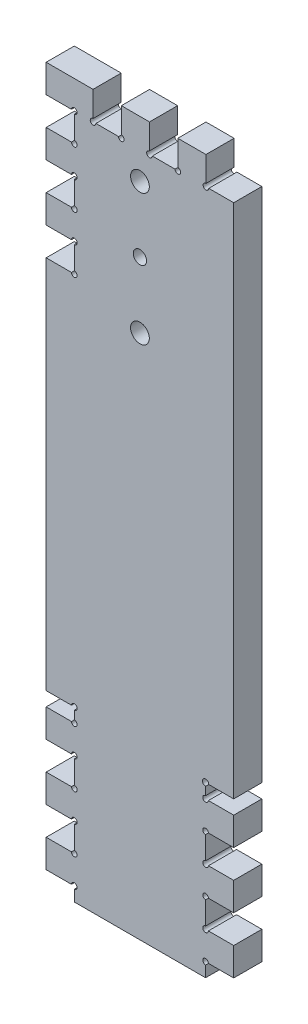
ISO-10303-21;
HEADER;
FILE_DESCRIPTION(('STEP AP214'),'2;1');
FILE_NAME('part.step','',(''),(''),'','','');
FILE_SCHEMA(('AUTOMOTIVE_DESIGN { 1 0 10303 214 1 1 1 1 }'));
ENDSEC;
DATA;
#1=APPLICATION_CONTEXT('core data for automotive mechanical design processes');
#2=APPLICATION_PROTOCOL_DEFINITION('international standard','automotive_design',2000,#1);
#3=PRODUCT_CONTEXT('',#1,'mechanical');
#4=PRODUCT('Part','Part','',(#3));
#5=PRODUCT_RELATED_PRODUCT_CATEGORY('part','',(#4));
#6=PRODUCT_DEFINITION_FORMATION('','',#4);
#7=PRODUCT_DEFINITION_CONTEXT('part definition',#1,'design');
#8=PRODUCT_DEFINITION('design','',#6,#7);
#9=PRODUCT_DEFINITION_SHAPE('','',#8);
#10=(LENGTH_UNIT() NAMED_UNIT(*) SI_UNIT(.MILLI.,.METRE.));
#11=(NAMED_UNIT(*) PLANE_ANGLE_UNIT() SI_UNIT($,.RADIAN.));
#12=(NAMED_UNIT(*) SI_UNIT($,.STERADIAN.) SOLID_ANGLE_UNIT());
#13=UNCERTAINTY_MEASURE_WITH_UNIT(LENGTH_MEASURE(1.E-05),#10,'distance_accuracy_value','');
#14=(GEOMETRIC_REPRESENTATION_CONTEXT(3) GLOBAL_UNCERTAINTY_ASSIGNED_CONTEXT((#13)) GLOBAL_UNIT_ASSIGNED_CONTEXT((#10,
#11,#12)) REPRESENTATION_CONTEXT('',''));
#15=CARTESIAN_POINT('',(0.,0.,0.));
#16=DIRECTION('',(0.,0.,1.));
#17=DIRECTION('',(1.,0.,0.));
#18=AXIS2_PLACEMENT_3D('',#15,#16,#17);
#19=CARTESIAN_POINT('',(15.,82.6,15.));
#20=DIRECTION('',(0.,0.,-1.));
#21=DIRECTION('',(-1.,0.,0.));
#22=AXIS2_PLACEMENT_3D('',#19,#20,#21);
#23=CYLINDRICAL_SURFACE('',#22,1.5);
#24=CARTESIAN_POINT('',(15.,82.6,0.));
#25=DIRECTION('',(0.,0.,-1.));
#26=DIRECTION('',(1.,0.,0.));
#27=AXIS2_PLACEMENT_3D('',#24,#25,#26);
#28=CIRCLE('',#27,1.5);
#29=CARTESIAN_POINT('',(15.,84.1,0.));
#30=VERTEX_POINT('',#29);
#31=CARTESIAN_POINT('',(13.5,82.6,0.));
#32=VERTEX_POINT('',#31);
#33=EDGE_CURVE('E561',#30,#32,#28,.T.);
#34=ORIENTED_EDGE('',*,*,#33,.T.);
#35=DIRECTION('',(0.,0.,-1.));
#36=VECTOR('',#35,1.);
#37=CARTESIAN_POINT('',(13.5,82.6,15.));
#38=LINE('',#37,#36);
#39=CARTESIAN_POINT('',(13.5,82.6,15.));
#40=VERTEX_POINT('',#39);
#41=EDGE_CURVE('E11',#40,#32,#38,.T.);
#42=ORIENTED_EDGE('',*,*,#41,.F.);
#43=CARTESIAN_POINT('',(15.,82.6,15.));
#44=DIRECTION('',(0.,0.,-1.));
#45=DIRECTION('',(1.,0.,0.));
#46=AXIS2_PLACEMENT_3D('',#43,#44,#45);
#47=CIRCLE('',#46,1.5);
#48=CARTESIAN_POINT('',(15.,84.1,15.));
#49=VERTEX_POINT('',#48);
#50=EDGE_CURVE('E719',#49,#40,#47,.T.);
#51=ORIENTED_EDGE('',*,*,#50,.F.);
#52=DIRECTION('',(0.,0.,-1.));
#53=VECTOR('',#52,1.);
#54=CARTESIAN_POINT('',(15.,84.1,15.));
#55=LINE('',#54,#53);
#56=EDGE_CURVE('E557',#49,#30,#55,.T.);
#57=ORIENTED_EDGE('',*,*,#56,.T.);
#58=EDGE_LOOP('',(#34,#42,#51,#57));
#59=FACE_BOUND('',#58,.T.);
#60=ADVANCED_FACE('F39',(#59),#23,.F.);
#61=CARTESIAN_POINT('',(0.,82.6,15.));
#62=DIRECTION('',(0.,-1.,0.));
#63=DIRECTION('',(0.,0.,-1.));
#64=AXIS2_PLACEMENT_3D('',#61,#62,#63);
#65=PLANE('',#64);
#66=DIRECTION('',(-1.,0.,0.));
#67=VECTOR('',#66,1.);
#68=CARTESIAN_POINT('',(0.,82.6,0.));
#69=LINE('',#68,#67);
#70=CARTESIAN_POINT('',(0.,82.6,0.));
#71=VERTEX_POINT('',#70);
#72=EDGE_CURVE('E564',#32,#71,#69,.T.);
#73=ORIENTED_EDGE('',*,*,#72,.T.);
#74=DIRECTION('',(0.,0.,-1.));
#75=VECTOR('',#74,1.);
#76=CARTESIAN_POINT('',(0.,82.6,15.));
#77=LINE('',#76,#75);
#78=CARTESIAN_POINT('',(0.,82.6,15.));
#79=VERTEX_POINT('',#78);
#80=EDGE_CURVE('E47',#79,#71,#77,.T.);
#81=ORIENTED_EDGE('',*,*,#80,.F.);
#82=DIRECTION('',(-1.,0.,0.));
#83=VECTOR('',#82,1.);
#84=CARTESIAN_POINT('',(0.,82.6,15.));
#85=LINE('',#84,#83);
#86=EDGE_CURVE('E311',#40,#79,#85,.T.);
#87=ORIENTED_EDGE('',*,*,#86,.F.);
#88=ORIENTED_EDGE('',*,*,#41,.T.);
#89=EDGE_LOOP('',(#73,#81,#87,#88));
#90=FACE_BOUND('',#89,.T.);
#91=ADVANCED_FACE('F1134',(#90),#65,.F.);
#92=CARTESIAN_POINT('',(0.,82.6,15.));
#93=DIRECTION('',(1.,0.,0.));
#94=DIRECTION('',(0.,0.,-1.));
#95=AXIS2_PLACEMENT_3D('',#92,#93,#94);
#96=PLANE('',#95);
#97=DIRECTION('',(0.,-1.,0.));
#98=VECTOR('',#97,1.);
#99=CARTESIAN_POINT('',(0.,82.6,0.));
#100=LINE('',#99,#98);
#101=CARTESIAN_POINT('',(0.,67.6,0.));
#102=VERTEX_POINT('',#101);
#103=EDGE_CURVE('E567',#71,#102,#100,.T.);
#104=ORIENTED_EDGE('',*,*,#103,.T.);
#105=DIRECTION('',(0.,0.,-1.));
#106=VECTOR('',#105,1.);
#107=CARTESIAN_POINT('',(0.,67.6,15.));
#108=LINE('',#107,#106);
#109=CARTESIAN_POINT('',(0.,67.6,15.));
#110=VERTEX_POINT('',#109);
#111=EDGE_CURVE('E939',#110,#102,#108,.T.);
#112=ORIENTED_EDGE('',*,*,#111,.F.);
#113=DIRECTION('',(0.,-1.,0.));
#114=VECTOR('',#113,1.);
#115=CARTESIAN_POINT('',(0.,82.6,15.));
#116=LINE('',#115,#114);
#117=EDGE_CURVE('E947',#79,#110,#116,.T.);
#118=ORIENTED_EDGE('',*,*,#117,.F.);
#119=ORIENTED_EDGE('',*,*,#80,.T.);
#120=EDGE_LOOP('',(#104,#112,#118,#119));
#121=FACE_BOUND('',#120,.T.);
#122=ADVANCED_FACE('F945',(#121),#96,.F.);
#123=CARTESIAN_POINT('',(0.,67.6,15.));
#124=DIRECTION('',(0.,1.,0.));
#125=DIRECTION('',(0.,0.,1.));
#126=AXIS2_PLACEMENT_3D('',#123,#124,#125);
#127=PLANE('',#126);
#128=DIRECTION('',(1.,0.,0.));
#129=VECTOR('',#128,1.);
#130=CARTESIAN_POINT('',(0.,67.6,0.));
#131=LINE('',#130,#129);
#132=CARTESIAN_POINT('',(13.5,67.6,0.));
#133=VERTEX_POINT('',#132);
#134=EDGE_CURVE('E569',#102,#133,#131,.T.);
#135=ORIENTED_EDGE('',*,*,#134,.T.);
#136=DIRECTION('',(0.,0.,-1.));
#137=VECTOR('',#136,1.);
#138=CARTESIAN_POINT('',(13.5,67.6,15.));
#139=LINE('',#138,#137);
#140=CARTESIAN_POINT('',(13.5,67.6,15.));
#141=VERTEX_POINT('',#140);
#142=EDGE_CURVE('E936',#141,#133,#139,.T.);
#143=ORIENTED_EDGE('',*,*,#142,.F.);
#144=DIRECTION('',(1.,0.,0.));
#145=VECTOR('',#144,1.);
#146=CARTESIAN_POINT('',(0.,67.6,15.));
#147=LINE('',#146,#145);
#148=EDGE_CURVE('E965',#110,#141,#147,.T.);
#149=ORIENTED_EDGE('',*,*,#148,.F.);
#150=ORIENTED_EDGE('',*,*,#111,.T.);
#151=EDGE_LOOP('',(#135,#143,#149,#150));
#152=FACE_BOUND('',#151,.T.);
#153=ADVANCED_FACE('F956',(#152),#127,.F.);
#154=CARTESIAN_POINT('',(15.,67.6,15.));
#155=DIRECTION('',(0.,0.,-1.));
#156=DIRECTION('',(-1.,0.,0.));
#157=AXIS2_PLACEMENT_3D('',#154,#155,#156);
#158=CYLINDRICAL_SURFACE('',#157,1.5);
#159=CARTESIAN_POINT('',(15.,67.6,0.));
#160=DIRECTION('',(0.,0.,-1.));
#161=DIRECTION('',(-1.,0.,0.));
#162=AXIS2_PLACEMENT_3D('',#159,#160,#161);
#163=CIRCLE('',#162,1.5);
#164=CARTESIAN_POINT('',(15.,66.1,0.));
#165=VERTEX_POINT('',#164);
#166=EDGE_CURVE('E571',#133,#165,#163,.T.);
#167=ORIENTED_EDGE('',*,*,#166,.T.);
#168=DIRECTION('',(0.,0.,-1.));
#169=VECTOR('',#168,1.);
#170=CARTESIAN_POINT('',(15.,66.1,15.));
#171=LINE('',#170,#169);
#172=CARTESIAN_POINT('',(15.,66.1,15.));
#173=VERTEX_POINT('',#172);
#174=EDGE_CURVE('E933',#173,#165,#171,.T.);
#175=ORIENTED_EDGE('',*,*,#174,.F.);
#176=CARTESIAN_POINT('',(15.,67.6,15.));
#177=DIRECTION('',(0.,0.,-1.));
#178=DIRECTION('',(-1.,0.,0.));
#179=AXIS2_PLACEMENT_3D('',#176,#177,#178);
#180=CIRCLE('',#179,1.5);
#181=EDGE_CURVE('E962',#141,#173,#180,.T.);
#182=ORIENTED_EDGE('',*,*,#181,.F.);
#183=ORIENTED_EDGE('',*,*,#142,.T.);
#184=EDGE_LOOP('',(#167,#175,#182,#183));
#185=FACE_BOUND('',#184,.T.);
#186=ADVANCED_FACE('F960',(#185),#158,.F.);
#187=CARTESIAN_POINT('',(15.,66.1,15.));
#188=DIRECTION('',(1.,0.,0.));
#189=DIRECTION('',(0.,1.,0.));
#190=AXIS2_PLACEMENT_3D('',#187,#188,#189);
#191=PLANE('',#190);
#192=DIRECTION('',(0.,-1.,0.));
#193=VECTOR('',#192,1.);
#194=CARTESIAN_POINT('',(15.,66.1,0.));
#195=LINE('',#194,#193);
#196=CARTESIAN_POINT('',(15.,54.,0.));
#197=VERTEX_POINT('',#196);
#198=EDGE_CURVE('E573',#165,#197,#195,.T.);
#199=ORIENTED_EDGE('',*,*,#198,.T.);
#200=DIRECTION('',(0.,0.,-1.));
#201=VECTOR('',#200,1.);
#202=CARTESIAN_POINT('',(15.,54.,15.));
#203=LINE('',#202,#201);
#204=CARTESIAN_POINT('',(15.,54.,15.));
#205=VERTEX_POINT('',#204);
#206=EDGE_CURVE('E930',#205,#197,#203,.T.);
#207=ORIENTED_EDGE('',*,*,#206,.F.);
#208=DIRECTION('',(0.,-1.,0.));
#209=VECTOR('',#208,1.);
#210=CARTESIAN_POINT('',(15.,66.1,15.));
#211=LINE('',#210,#209);
#212=EDGE_CURVE('E964',#173,#205,#211,.T.);
#213=ORIENTED_EDGE('',*,*,#212,.F.);
#214=ORIENTED_EDGE('',*,*,#174,.T.);
#215=EDGE_LOOP('',(#199,#207,#213,#214));
#216=FACE_BOUND('',#215,.T.);
#217=ADVANCED_FACE('F1147',(#216),#191,.F.);
#218=CARTESIAN_POINT('',(15.,52.5,15.));
#219=DIRECTION('',(0.,0.,-1.));
#220=DIRECTION('',(-1.,0.,0.));
#221=AXIS2_PLACEMENT_3D('',#218,#219,#220);
#222=CYLINDRICAL_SURFACE('',#221,1.5);
#223=CARTESIAN_POINT('',(15.,52.5,0.));
#224=DIRECTION('',(0.,0.,-1.));
#225=DIRECTION('',(-1.,0.,0.));
#226=AXIS2_PLACEMENT_3D('',#223,#224,#225);
#227=CIRCLE('',#226,1.5);
#228=CARTESIAN_POINT('',(13.5,52.5,0.));
#229=VERTEX_POINT('',#228);
#230=EDGE_CURVE('E575',#197,#229,#227,.T.);
#231=ORIENTED_EDGE('',*,*,#230,.T.);
#232=DIRECTION('',(0.,0.,-1.));
#233=VECTOR('',#232,1.);
#234=CARTESIAN_POINT('',(13.5,52.5,15.));
#235=LINE('',#234,#233);
#236=CARTESIAN_POINT('',(13.5,52.5,15.));
#237=VERTEX_POINT('',#236);
#238=EDGE_CURVE('E927',#237,#229,#235,.T.);
#239=ORIENTED_EDGE('',*,*,#238,.F.);
#240=CARTESIAN_POINT('',(15.,52.5,15.));
#241=DIRECTION('',(0.,0.,-1.));
#242=DIRECTION('',(-1.,0.,0.));
#243=AXIS2_PLACEMENT_3D('',#240,#241,#242);
#244=CIRCLE('',#243,1.5);
#245=EDGE_CURVE('E967',#205,#237,#244,.T.);
#246=ORIENTED_EDGE('',*,*,#245,.F.);
#247=ORIENTED_EDGE('',*,*,#206,.T.);
#248=EDGE_LOOP('',(#231,#239,#246,#247));
#249=FACE_BOUND('',#248,.T.);
#250=ADVANCED_FACE('F1150',(#249),#222,.F.);
#251=CARTESIAN_POINT('',(13.5,52.5,15.));
#252=DIRECTION('',(0.,-1.,0.));
#253=DIRECTION('',(0.,0.,-1.));
#254=AXIS2_PLACEMENT_3D('',#251,#252,#253);
#255=PLANE('',#254);
#256=DIRECTION('',(-1.,0.,0.));
#257=VECTOR('',#256,1.);
#258=CARTESIAN_POINT('',(13.5,52.5,0.));
#259=LINE('',#258,#257);
#260=CARTESIAN_POINT('',(0.,52.5,0.));
#261=VERTEX_POINT('',#260);
#262=EDGE_CURVE('E577',#229,#261,#259,.T.);
#263=ORIENTED_EDGE('',*,*,#262,.T.);
#264=DIRECTION('',(0.,0.,-1.));
#265=VECTOR('',#264,1.);
#266=CARTESIAN_POINT('',(0.,52.5,15.));
#267=LINE('',#266,#265);
#268=CARTESIAN_POINT('',(0.,52.5,15.));
#269=VERTEX_POINT('',#268);
#270=EDGE_CURVE('E924',#269,#261,#267,.T.);
#271=ORIENTED_EDGE('',*,*,#270,.F.);
#272=DIRECTION('',(-1.,0.,0.));
#273=VECTOR('',#272,1.);
#274=CARTESIAN_POINT('',(13.5,52.5,15.));
#275=LINE('',#274,#273);
#276=EDGE_CURVE('E973',#237,#269,#275,.T.);
#277=ORIENTED_EDGE('',*,*,#276,.F.);
#278=ORIENTED_EDGE('',*,*,#238,.T.);
#279=EDGE_LOOP('',(#263,#271,#277,#278));
#280=FACE_BOUND('',#279,.T.);
#281=ADVANCED_FACE('F1154',(#280),#255,.F.);
#282=CARTESIAN_POINT('',(0.,52.5,15.));
#283=DIRECTION('',(1.,0.,0.));
#284=DIRECTION('',(0.,0.,-1.));
#285=AXIS2_PLACEMENT_3D('',#282,#283,#284);
#286=PLANE('',#285);
#287=DIRECTION('',(0.,-1.,0.));
#288=VECTOR('',#287,1.);
#289=CARTESIAN_POINT('',(0.,52.5,0.));
#290=LINE('',#289,#288);
#291=CARTESIAN_POINT('',(0.,37.5,0.));
#292=VERTEX_POINT('',#291);
#293=EDGE_CURVE('E579',#261,#292,#290,.T.);
#294=ORIENTED_EDGE('',*,*,#293,.T.);
#295=DIRECTION('',(0.,0.,-1.));
#296=VECTOR('',#295,1.);
#297=CARTESIAN_POINT('',(0.,37.5,15.));
#298=LINE('',#297,#296);
#299=CARTESIAN_POINT('',(0.,37.5,15.));
#300=VERTEX_POINT('',#299);
#301=EDGE_CURVE('E921',#300,#292,#298,.T.);
#302=ORIENTED_EDGE('',*,*,#301,.F.);
#303=DIRECTION('',(0.,-1.,0.));
#304=VECTOR('',#303,1.);
#305=CARTESIAN_POINT('',(0.,52.5,15.));
#306=LINE('',#305,#304);
#307=EDGE_CURVE('E975',#269,#300,#306,.T.);
#308=ORIENTED_EDGE('',*,*,#307,.F.);
#309=ORIENTED_EDGE('',*,*,#270,.T.);
#310=EDGE_LOOP('',(#294,#302,#308,#309));
#311=FACE_BOUND('',#310,.T.);
#312=ADVANCED_FACE('F1158',(#311),#286,.F.);
#313=CARTESIAN_POINT('',(0.,37.5,15.));
#314=DIRECTION('',(0.,1.,0.));
#315=DIRECTION('',(0.,0.,1.));
#316=AXIS2_PLACEMENT_3D('',#313,#314,#315);
#317=PLANE('',#316);
#318=DIRECTION('',(1.,0.,0.));
#319=VECTOR('',#318,1.);
#320=CARTESIAN_POINT('',(0.,37.5,0.));
#321=LINE('',#320,#319);
#322=CARTESIAN_POINT('',(13.5,37.5,0.));
#323=VERTEX_POINT('',#322);
#324=EDGE_CURVE('E581',#292,#323,#321,.T.);
#325=ORIENTED_EDGE('',*,*,#324,.T.);
#326=DIRECTION('',(0.,0.,-1.));
#327=VECTOR('',#326,1.);
#328=CARTESIAN_POINT('',(13.5,37.5,15.));
#329=LINE('',#328,#327);
#330=CARTESIAN_POINT('',(13.5,37.5,15.));
#331=VERTEX_POINT('',#330);
#332=EDGE_CURVE('E918',#331,#323,#329,.T.);
#333=ORIENTED_EDGE('',*,*,#332,.F.);
#334=DIRECTION('',(1.,0.,0.));
#335=VECTOR('',#334,1.);
#336=CARTESIAN_POINT('',(0.,37.5,15.));
#337=LINE('',#336,#335);
#338=EDGE_CURVE('E977',#300,#331,#337,.T.);
#339=ORIENTED_EDGE('',*,*,#338,.F.);
#340=ORIENTED_EDGE('',*,*,#301,.T.);
#341=EDGE_LOOP('',(#325,#333,#339,#340));
#342=FACE_BOUND('',#341,.T.);
#343=ADVANCED_FACE('F1162',(#342),#317,.F.);
#344=CARTESIAN_POINT('',(15.,37.5,15.));
#345=DIRECTION('',(0.,0.,-1.));
#346=DIRECTION('',(-1.,0.,0.));
#347=AXIS2_PLACEMENT_3D('',#344,#345,#346);
#348=CYLINDRICAL_SURFACE('',#347,1.5);
#349=CARTESIAN_POINT('',(15.,37.5,0.));
#350=DIRECTION('',(0.,0.,-1.));
#351=DIRECTION('',(-1.,0.,0.));
#352=AXIS2_PLACEMENT_3D('',#349,#350,#351);
#353=CIRCLE('',#352,1.5);
#354=CARTESIAN_POINT('',(15.,36.,0.));
#355=VERTEX_POINT('',#354);
#356=EDGE_CURVE('E583',#323,#355,#353,.T.);
#357=ORIENTED_EDGE('',*,*,#356,.T.);
#358=DIRECTION('',(0.,0.,-1.));
#359=VECTOR('',#358,1.);
#360=CARTESIAN_POINT('',(15.,36.,15.));
#361=LINE('',#360,#359);
#362=CARTESIAN_POINT('',(15.,36.,15.));
#363=VERTEX_POINT('',#362);
#364=EDGE_CURVE('E915',#363,#355,#361,.T.);
#365=ORIENTED_EDGE('',*,*,#364,.F.);
#366=CARTESIAN_POINT('',(15.,37.5,15.));
#367=DIRECTION('',(0.,0.,-1.));
#368=DIRECTION('',(-1.,0.,0.));
#369=AXIS2_PLACEMENT_3D('',#366,#367,#368);
#370=CIRCLE('',#369,1.5);
#371=EDGE_CURVE('E979',#331,#363,#370,.T.);
#372=ORIENTED_EDGE('',*,*,#371,.F.);
#373=ORIENTED_EDGE('',*,*,#332,.T.);
#374=EDGE_LOOP('',(#357,#365,#372,#373));
#375=FACE_BOUND('',#374,.T.);
#376=ADVANCED_FACE('F1166',(#375),#348,.F.);
#377=CARTESIAN_POINT('',(15.,36.,15.));
#378=DIRECTION('',(1.,0.,0.));
#379=DIRECTION('',(0.,0.,-1.));
#380=AXIS2_PLACEMENT_3D('',#377,#378,#379);
#381=PLANE('',#380);
#382=DIRECTION('',(0.,-1.,0.));
#383=VECTOR('',#382,1.);
#384=CARTESIAN_POINT('',(15.,36.,0.));
#385=LINE('',#384,#383);
#386=CARTESIAN_POINT('',(15.,23.9,0.));
#387=VERTEX_POINT('',#386);
#388=EDGE_CURVE('E585',#355,#387,#385,.T.);
#389=ORIENTED_EDGE('',*,*,#388,.T.);
#390=DIRECTION('',(0.,0.,-1.));
#391=VECTOR('',#390,1.);
#392=CARTESIAN_POINT('',(15.,23.9,15.));
#393=LINE('',#392,#391);
#394=CARTESIAN_POINT('',(15.,23.9,15.));
#395=VERTEX_POINT('',#394);
#396=EDGE_CURVE('E912',#395,#387,#393,.T.);
#397=ORIENTED_EDGE('',*,*,#396,.F.);
#398=DIRECTION('',(0.,-1.,0.));
#399=VECTOR('',#398,1.);
#400=CARTESIAN_POINT('',(15.,36.,15.));
#401=LINE('',#400,#399);
#402=EDGE_CURVE('E981',#363,#395,#401,.T.);
#403=ORIENTED_EDGE('',*,*,#402,.F.);
#404=ORIENTED_EDGE('',*,*,#364,.T.);
#405=EDGE_LOOP('',(#389,#397,#403,#404));
#406=FACE_BOUND('',#405,.T.);
#407=ADVANCED_FACE('F1170',(#406),#381,.F.);
#408=CARTESIAN_POINT('',(15.,22.4,15.));
#409=DIRECTION('',(0.,0.,-1.));
#410=DIRECTION('',(-1.,0.,0.));
#411=AXIS2_PLACEMENT_3D('',#408,#409,#410);
#412=CYLINDRICAL_SURFACE('',#411,1.49999999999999);
#413=CARTESIAN_POINT('',(15.,22.4,0.));
#414=DIRECTION('',(0.,0.,-1.));
#415=DIRECTION('',(-1.,0.,0.));
#416=AXIS2_PLACEMENT_3D('',#413,#414,#415);
#417=CIRCLE('',#416,1.49999999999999);
#418=CARTESIAN_POINT('',(13.5,22.4,0.));
#419=VERTEX_POINT('',#418);
#420=EDGE_CURVE('E587',#387,#419,#417,.T.);
#421=ORIENTED_EDGE('',*,*,#420,.T.);
#422=DIRECTION('',(0.,0.,-1.));
#423=VECTOR('',#422,1.);
#424=CARTESIAN_POINT('',(13.5,22.4,15.));
#425=LINE('',#424,#423);
#426=CARTESIAN_POINT('',(13.5,22.4,15.));
#427=VERTEX_POINT('',#426);
#428=EDGE_CURVE('E909',#427,#419,#425,.T.);
#429=ORIENTED_EDGE('',*,*,#428,.F.);
#430=CARTESIAN_POINT('',(15.,22.4,15.));
#431=DIRECTION('',(0.,0.,-1.));
#432=DIRECTION('',(-1.,0.,0.));
#433=AXIS2_PLACEMENT_3D('',#430,#431,#432);
#434=CIRCLE('',#433,1.49999999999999);
#435=EDGE_CURVE('E983',#395,#427,#434,.T.);
#436=ORIENTED_EDGE('',*,*,#435,.F.);
#437=ORIENTED_EDGE('',*,*,#396,.T.);
#438=EDGE_LOOP('',(#421,#429,#436,#437));
#439=FACE_BOUND('',#438,.T.);
#440=ADVANCED_FACE('F1174',(#439),#412,.F.);
#441=CARTESIAN_POINT('',(13.5,22.4,15.));
#442=DIRECTION('',(0.,-1.,0.));
#443=DIRECTION('',(0.,0.,-1.));
#444=AXIS2_PLACEMENT_3D('',#441,#442,#443);
#445=PLANE('',#444);
#446=DIRECTION('',(-1.,0.,0.));
#447=VECTOR('',#446,1.);
#448=CARTESIAN_POINT('',(13.5,22.4,0.));
#449=LINE('',#448,#447);
#450=CARTESIAN_POINT('',(0.,22.4,0.));
#451=VERTEX_POINT('',#450);
#452=EDGE_CURVE('E589',#419,#451,#449,.T.);
#453=ORIENTED_EDGE('',*,*,#452,.T.);
#454=DIRECTION('',(0.,0.,-1.));
#455=VECTOR('',#454,1.);
#456=CARTESIAN_POINT('',(0.,22.4,15.));
#457=LINE('',#456,#455);
#458=CARTESIAN_POINT('',(0.,22.4,15.));
#459=VERTEX_POINT('',#458);
#460=EDGE_CURVE('E906',#459,#451,#457,.T.);
#461=ORIENTED_EDGE('',*,*,#460,.F.);
#462=DIRECTION('',(-1.,0.,0.));
#463=VECTOR('',#462,1.);
#464=CARTESIAN_POINT('',(13.5,22.4,15.));
#465=LINE('',#464,#463);
#466=EDGE_CURVE('E985',#427,#459,#465,.T.);
#467=ORIENTED_EDGE('',*,*,#466,.F.);
#468=ORIENTED_EDGE('',*,*,#428,.T.);
#469=EDGE_LOOP('',(#453,#461,#467,#468));
#470=FACE_BOUND('',#469,.T.);
#471=ADVANCED_FACE('F1178',(#470),#445,.F.);
#472=CARTESIAN_POINT('',(0.,22.4,15.));
#473=DIRECTION('',(1.,0.,0.));
#474=DIRECTION('',(0.,0.,-1.));
#475=AXIS2_PLACEMENT_3D('',#472,#473,#474);
#476=PLANE('',#475);
#477=DIRECTION('',(0.,-1.,0.));
#478=VECTOR('',#477,1.);
#479=CARTESIAN_POINT('',(0.,22.4,0.));
#480=LINE('',#479,#478);
#481=CARTESIAN_POINT('',(0.,7.4,0.));
#482=VERTEX_POINT('',#481);
#483=EDGE_CURVE('E591',#451,#482,#480,.T.);
#484=ORIENTED_EDGE('',*,*,#483,.T.);
#485=DIRECTION('',(0.,0.,-1.));
#486=VECTOR('',#485,1.);
#487=CARTESIAN_POINT('',(0.,7.4,15.));
#488=LINE('',#487,#486);
#489=CARTESIAN_POINT('',(0.,7.4,15.));
#490=VERTEX_POINT('',#489);
#491=EDGE_CURVE('E903',#490,#482,#488,.T.);
#492=ORIENTED_EDGE('',*,*,#491,.F.);
#493=DIRECTION('',(0.,-1.,0.));
#494=VECTOR('',#493,1.);
#495=CARTESIAN_POINT('',(0.,22.4,15.));
#496=LINE('',#495,#494);
#497=EDGE_CURVE('E987',#459,#490,#496,.T.);
#498=ORIENTED_EDGE('',*,*,#497,.F.);
#499=ORIENTED_EDGE('',*,*,#460,.T.);
#500=EDGE_LOOP('',(#484,#492,#498,#499));
#501=FACE_BOUND('',#500,.T.);
#502=ADVANCED_FACE('F1182',(#501),#476,.F.);
#503=CARTESIAN_POINT('',(0.,7.4,15.));
#504=DIRECTION('',(0.,1.,0.));
#505=DIRECTION('',(0.,0.,1.));
#506=AXIS2_PLACEMENT_3D('',#503,#504,#505);
#507=PLANE('',#506);
#508=DIRECTION('',(1.,0.,0.));
#509=VECTOR('',#508,1.);
#510=CARTESIAN_POINT('',(0.,7.4,0.));
#511=LINE('',#510,#509);
#512=CARTESIAN_POINT('',(13.5,7.4,0.));
#513=VERTEX_POINT('',#512);
#514=EDGE_CURVE('E593',#482,#513,#511,.T.);
#515=ORIENTED_EDGE('',*,*,#514,.T.);
#516=DIRECTION('',(0.,0.,-1.));
#517=VECTOR('',#516,1.);
#518=CARTESIAN_POINT('',(13.5,7.4,15.));
#519=LINE('',#518,#517);
#520=CARTESIAN_POINT('',(13.5,7.4,15.));
#521=VERTEX_POINT('',#520);
#522=EDGE_CURVE('E900',#521,#513,#519,.T.);
#523=ORIENTED_EDGE('',*,*,#522,.F.);
#524=DIRECTION('',(1.,0.,0.));
#525=VECTOR('',#524,1.);
#526=CARTESIAN_POINT('',(0.,7.4,15.));
#527=LINE('',#526,#525);
#528=EDGE_CURVE('E989',#490,#521,#527,.T.);
#529=ORIENTED_EDGE('',*,*,#528,.F.);
#530=ORIENTED_EDGE('',*,*,#491,.T.);
#531=EDGE_LOOP('',(#515,#523,#529,#530));
#532=FACE_BOUND('',#531,.T.);
#533=ADVANCED_FACE('F1186',(#532),#507,.F.);
#534=CARTESIAN_POINT('',(15.,7.4,15.));
#535=DIRECTION('',(0.,0.,-1.));
#536=DIRECTION('',(-1.,0.,0.));
#537=AXIS2_PLACEMENT_3D('',#534,#535,#536);
#538=CYLINDRICAL_SURFACE('',#537,1.5);
#539=CARTESIAN_POINT('',(15.,7.4,0.));
#540=DIRECTION('',(0.,0.,-1.));
#541=DIRECTION('',(-1.,0.,0.));
#542=AXIS2_PLACEMENT_3D('',#539,#540,#541);
#543=CIRCLE('',#542,1.5);
#544=CARTESIAN_POINT('',(15.,5.9,0.));
#545=VERTEX_POINT('',#544);
#546=EDGE_CURVE('E595',#513,#545,#543,.T.);
#547=ORIENTED_EDGE('',*,*,#546,.T.);
#548=DIRECTION('',(0.,0.,-1.));
#549=VECTOR('',#548,1.);
#550=CARTESIAN_POINT('',(15.,5.9,15.));
#551=LINE('',#550,#549);
#552=CARTESIAN_POINT('',(15.,5.9,15.));
#553=VERTEX_POINT('',#552);
#554=EDGE_CURVE('E897',#553,#545,#551,.T.);
#555=ORIENTED_EDGE('',*,*,#554,.F.);
#556=CARTESIAN_POINT('',(15.,7.4,15.));
#557=DIRECTION('',(0.,0.,-1.));
#558=DIRECTION('',(-1.,0.,0.));
#559=AXIS2_PLACEMENT_3D('',#556,#557,#558);
#560=CIRCLE('',#559,1.5);
#561=EDGE_CURVE('E991',#521,#553,#560,.T.);
#562=ORIENTED_EDGE('',*,*,#561,.F.);
#563=ORIENTED_EDGE('',*,*,#522,.T.);
#564=EDGE_LOOP('',(#547,#555,#562,#563));
#565=FACE_BOUND('',#564,.T.);
#566=ADVANCED_FACE('F1190',(#565),#538,.F.);
#567=CARTESIAN_POINT('',(15.,5.9,15.));
#568=DIRECTION('',(1.,0.,0.));
#569=DIRECTION('',(0.,0.,-1.));
#570=AXIS2_PLACEMENT_3D('',#567,#568,#569);
#571=PLANE('',#570);
#572=DIRECTION('',(0.,-1.,0.));
#573=VECTOR('',#572,1.);
#574=CARTESIAN_POINT('',(15.,5.9,0.));
#575=LINE('',#574,#573);
#576=CARTESIAN_POINT('',(15.,0.,0.));
#577=VERTEX_POINT('',#576);
#578=EDGE_CURVE('E597',#545,#577,#575,.T.);
#579=ORIENTED_EDGE('',*,*,#578,.T.);
#580=DIRECTION('',(0.,0.,-1.));
#581=VECTOR('',#580,1.);
#582=CARTESIAN_POINT('',(15.,0.,15.));
#583=LINE('',#582,#581);
#584=CARTESIAN_POINT('',(15.,0.,15.));
#585=VERTEX_POINT('',#584);
#586=EDGE_CURVE('E894',#585,#577,#583,.T.);
#587=ORIENTED_EDGE('',*,*,#586,.F.);
#588=DIRECTION('',(0.,-1.,0.));
#589=VECTOR('',#588,1.);
#590=CARTESIAN_POINT('',(15.,5.9,15.));
#591=LINE('',#590,#589);
#592=EDGE_CURVE('E993',#553,#585,#591,.T.);
#593=ORIENTED_EDGE('',*,*,#592,.F.);
#594=ORIENTED_EDGE('',*,*,#554,.T.);
#595=EDGE_LOOP('',(#579,#587,#593,#594));
#596=FACE_BOUND('',#595,.T.);
#597=ADVANCED_FACE('F1194',(#596),#571,.F.);
#598=CARTESIAN_POINT('',(85.,0.,15.));
#599=DIRECTION('',(0.,1.,0.));
#600=DIRECTION('',(0.,0.,1.));
#601=AXIS2_PLACEMENT_3D('',#598,#599,#600);
#602=PLANE('',#601);
#603=DIRECTION('',(1.,0.,0.));
#604=VECTOR('',#603,1.);
#605=CARTESIAN_POINT('',(85.,0.,0.));
#606=LINE('',#605,#604);
#607=CARTESIAN_POINT('',(85.,0.,0.));
#608=VERTEX_POINT('',#607);
#609=EDGE_CURVE('E599',#577,#608,#606,.T.);
#610=ORIENTED_EDGE('',*,*,#609,.T.);
#611=DIRECTION('',(0.,0.,-1.));
#612=VECTOR('',#611,1.);
#613=CARTESIAN_POINT('',(85.,0.,15.));
#614=LINE('',#613,#612);
#615=CARTESIAN_POINT('',(85.,0.,15.));
#616=VERTEX_POINT('',#615);
#617=EDGE_CURVE('E891',#616,#608,#614,.T.);
#618=ORIENTED_EDGE('',*,*,#617,.F.);
#619=DIRECTION('',(1.,0.,0.));
#620=VECTOR('',#619,1.);
#621=CARTESIAN_POINT('',(85.,0.,15.));
#622=LINE('',#621,#620);
#623=EDGE_CURVE('E995',#585,#616,#622,.T.);
#624=ORIENTED_EDGE('',*,*,#623,.F.);
#625=ORIENTED_EDGE('',*,*,#586,.T.);
#626=EDGE_LOOP('',(#610,#618,#624,#625));
#627=FACE_BOUND('',#626,.T.);
#628=ADVANCED_FACE('F1198',(#627),#602,.F.);
#629=CARTESIAN_POINT('',(85.,5.89999999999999,15.));
#630=DIRECTION('',(-1.,0.,0.));
#631=DIRECTION('',(0.,-1.,0.));
#632=AXIS2_PLACEMENT_3D('',#629,#630,#631);
#633=PLANE('',#632);
#634=DIRECTION('',(0.,1.,0.));
#635=VECTOR('',#634,1.);
#636=CARTESIAN_POINT('',(85.,5.89999999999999,0.));
#637=LINE('',#636,#635);
#638=CARTESIAN_POINT('',(85.,5.89999999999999,0.));
#639=VERTEX_POINT('',#638);
#640=EDGE_CURVE('E601',#608,#639,#637,.T.);
#641=ORIENTED_EDGE('',*,*,#640,.T.);
#642=DIRECTION('',(0.,0.,-1.));
#643=VECTOR('',#642,1.);
#644=CARTESIAN_POINT('',(85.,5.89999999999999,15.));
#645=LINE('',#644,#643);
#646=CARTESIAN_POINT('',(85.,5.89999999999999,15.));
#647=VERTEX_POINT('',#646);
#648=EDGE_CURVE('E888',#647,#639,#645,.T.);
#649=ORIENTED_EDGE('',*,*,#648,.F.);
#650=DIRECTION('',(0.,1.,0.));
#651=VECTOR('',#650,1.);
#652=CARTESIAN_POINT('',(85.,5.89999999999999,15.));
#653=LINE('',#652,#651);
#654=EDGE_CURVE('E997',#616,#647,#653,.T.);
#655=ORIENTED_EDGE('',*,*,#654,.F.);
#656=ORIENTED_EDGE('',*,*,#617,.T.);
#657=EDGE_LOOP('',(#641,#649,#655,#656));
#658=FACE_BOUND('',#657,.T.);
#659=ADVANCED_FACE('F1202',(#658),#633,.F.);
#660=CARTESIAN_POINT('',(85.,7.4,15.));
#661=DIRECTION('',(0.,0.,-1.));
#662=DIRECTION('',(-1.,0.,0.));
#663=AXIS2_PLACEMENT_3D('',#660,#661,#662);
#664=CYLINDRICAL_SURFACE('',#663,1.5);
#665=CARTESIAN_POINT('',(85.,7.4,0.));
#666=DIRECTION('',(0.,0.,-1.));
#667=DIRECTION('',(1.,0.,0.));
#668=AXIS2_PLACEMENT_3D('',#665,#666,#667);
#669=CIRCLE('',#668,1.5);
#670=CARTESIAN_POINT('',(86.5,7.39999999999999,0.));
#671=VERTEX_POINT('',#670);
#672=EDGE_CURVE('E603',#639,#671,#669,.T.);
#673=ORIENTED_EDGE('',*,*,#672,.T.);
#674=DIRECTION('',(0.,0.,-1.));
#675=VECTOR('',#674,1.);
#676=CARTESIAN_POINT('',(86.5,7.39999999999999,15.));
#677=LINE('',#676,#675);
#678=CARTESIAN_POINT('',(86.5,7.39999999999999,15.));
#679=VERTEX_POINT('',#678);
#680=EDGE_CURVE('E885',#679,#671,#677,.T.);
#681=ORIENTED_EDGE('',*,*,#680,.F.);
#682=CARTESIAN_POINT('',(85.,7.4,15.));
#683=DIRECTION('',(0.,0.,-1.));
#684=DIRECTION('',(1.,0.,0.));
#685=AXIS2_PLACEMENT_3D('',#682,#683,#684);
#686=CIRCLE('',#685,1.5);
#687=EDGE_CURVE('E999',#647,#679,#686,.T.);
#688=ORIENTED_EDGE('',*,*,#687,.F.);
#689=ORIENTED_EDGE('',*,*,#648,.T.);
#690=EDGE_LOOP('',(#673,#681,#688,#689));
#691=FACE_BOUND('',#690,.T.);
#692=ADVANCED_FACE('F1206',(#691),#664,.F.);
#693=CARTESIAN_POINT('',(100.,7.4,15.));
#694=DIRECTION('',(0.,1.,0.));
#695=DIRECTION('',(-1.,0.,0.));
#696=AXIS2_PLACEMENT_3D('',#693,#694,#695);
#697=PLANE('',#696);
#698=DIRECTION('',(1.,0.,0.));
#699=VECTOR('',#698,1.);
#700=CARTESIAN_POINT('',(100.,7.4,0.));
#701=LINE('',#700,#699);
#702=CARTESIAN_POINT('',(100.,7.4,0.));
#703=VERTEX_POINT('',#702);
#704=EDGE_CURVE('E605',#671,#703,#701,.T.);
#705=ORIENTED_EDGE('',*,*,#704,.T.);
#706=DIRECTION('',(0.,0.,-1.));
#707=VECTOR('',#706,1.);
#708=CARTESIAN_POINT('',(100.,7.4,15.));
#709=LINE('',#708,#707);
#710=CARTESIAN_POINT('',(100.,7.4,15.));
#711=VERTEX_POINT('',#710);
#712=EDGE_CURVE('E882',#711,#703,#709,.T.);
#713=ORIENTED_EDGE('',*,*,#712,.F.);
#714=DIRECTION('',(1.,0.,0.));
#715=VECTOR('',#714,1.);
#716=CARTESIAN_POINT('',(100.,7.4,15.));
#717=LINE('',#716,#715);
#718=EDGE_CURVE('E1001',#679,#711,#717,.T.);
#719=ORIENTED_EDGE('',*,*,#718,.F.);
#720=ORIENTED_EDGE('',*,*,#680,.T.);
#721=EDGE_LOOP('',(#705,#713,#719,#720));
#722=FACE_BOUND('',#721,.T.);
#723=ADVANCED_FACE('F1210',(#722),#697,.F.);
#724=CARTESIAN_POINT('',(100.,22.4,15.));
#725=DIRECTION('',(-1.,0.,0.));
#726=DIRECTION('',(0.,0.,1.));
#727=AXIS2_PLACEMENT_3D('',#724,#725,#726);
#728=PLANE('',#727);
#729=DIRECTION('',(0.,1.,0.));
#730=VECTOR('',#729,1.);
#731=CARTESIAN_POINT('',(100.,22.4,0.));
#732=LINE('',#731,#730);
#733=CARTESIAN_POINT('',(100.,22.4,0.));
#734=VERTEX_POINT('',#733);
#735=EDGE_CURVE('E607',#703,#734,#732,.T.);
#736=ORIENTED_EDGE('',*,*,#735,.T.);
#737=DIRECTION('',(0.,0.,-1.));
#738=VECTOR('',#737,1.);
#739=CARTESIAN_POINT('',(100.,22.4,15.));
#740=LINE('',#739,#738);
#741=CARTESIAN_POINT('',(100.,22.4,15.));
#742=VERTEX_POINT('',#741);
#743=EDGE_CURVE('E879',#742,#734,#740,.T.);
#744=ORIENTED_EDGE('',*,*,#743,.F.);
#745=DIRECTION('',(0.,1.,0.));
#746=VECTOR('',#745,1.);
#747=CARTESIAN_POINT('',(100.,22.4,15.));
#748=LINE('',#747,#746);
#749=EDGE_CURVE('E1003',#711,#742,#748,.T.);
#750=ORIENTED_EDGE('',*,*,#749,.F.);
#751=ORIENTED_EDGE('',*,*,#712,.T.);
#752=EDGE_LOOP('',(#736,#744,#750,#751));
#753=FACE_BOUND('',#752,.T.);
#754=ADVANCED_FACE('F1214',(#753),#728,.F.);
#755=CARTESIAN_POINT('',(86.5,22.4,15.));
#756=DIRECTION('',(0.,-1.,0.));
#757=DIRECTION('',(1.,0.,0.));
#758=AXIS2_PLACEMENT_3D('',#755,#756,#757);
#759=PLANE('',#758);
#760=DIRECTION('',(-1.,0.,0.));
#761=VECTOR('',#760,1.);
#762=CARTESIAN_POINT('',(86.5,22.4,0.));
#763=LINE('',#762,#761);
#764=CARTESIAN_POINT('',(86.5,22.4,0.));
#765=VERTEX_POINT('',#764);
#766=EDGE_CURVE('E609',#734,#765,#763,.T.);
#767=ORIENTED_EDGE('',*,*,#766,.T.);
#768=DIRECTION('',(0.,0.,-1.));
#769=VECTOR('',#768,1.);
#770=CARTESIAN_POINT('',(86.5,22.4,15.));
#771=LINE('',#770,#769);
#772=CARTESIAN_POINT('',(86.5,22.4,15.));
#773=VERTEX_POINT('',#772);
#774=EDGE_CURVE('E876',#773,#765,#771,.T.);
#775=ORIENTED_EDGE('',*,*,#774,.F.);
#776=DIRECTION('',(-1.,0.,0.));
#777=VECTOR('',#776,1.);
#778=CARTESIAN_POINT('',(86.5,22.4,15.));
#779=LINE('',#778,#777);
#780=EDGE_CURVE('E1005',#742,#773,#779,.T.);
#781=ORIENTED_EDGE('',*,*,#780,.F.);
#782=ORIENTED_EDGE('',*,*,#743,.T.);
#783=EDGE_LOOP('',(#767,#775,#781,#782));
#784=FACE_BOUND('',#783,.T.);
#785=ADVANCED_FACE('F1218',(#784),#759,.F.);
#786=CARTESIAN_POINT('',(85.,22.4,15.));
#787=DIRECTION('',(0.,0.,-1.));
#788=DIRECTION('',(-1.,0.,0.));
#789=AXIS2_PLACEMENT_3D('',#786,#787,#788);
#790=CYLINDRICAL_SURFACE('',#789,1.5);
#791=CARTESIAN_POINT('',(85.,22.4,0.));
#792=DIRECTION('',(0.,0.,-1.));
#793=DIRECTION('',(1.,0.,0.));
#794=AXIS2_PLACEMENT_3D('',#791,#792,#793);
#795=CIRCLE('',#794,1.5);
#796=CARTESIAN_POINT('',(85.,23.9,0.));
#797=VERTEX_POINT('',#796);
#798=EDGE_CURVE('E611',#765,#797,#795,.T.);
#799=ORIENTED_EDGE('',*,*,#798,.T.);
#800=DIRECTION('',(0.,0.,-1.));
#801=VECTOR('',#800,1.);
#802=CARTESIAN_POINT('',(85.,23.9,15.));
#803=LINE('',#802,#801);
#804=CARTESIAN_POINT('',(85.,23.9,15.));
#805=VERTEX_POINT('',#804);
#806=EDGE_CURVE('E873',#805,#797,#803,.T.);
#807=ORIENTED_EDGE('',*,*,#806,.F.);
#808=CARTESIAN_POINT('',(85.,22.4,15.));
#809=DIRECTION('',(0.,0.,-1.));
#810=DIRECTION('',(1.,0.,0.));
#811=AXIS2_PLACEMENT_3D('',#808,#809,#810);
#812=CIRCLE('',#811,1.5);
#813=EDGE_CURVE('E1007',#773,#805,#812,.T.);
#814=ORIENTED_EDGE('',*,*,#813,.F.);
#815=ORIENTED_EDGE('',*,*,#774,.T.);
#816=EDGE_LOOP('',(#799,#807,#814,#815));
#817=FACE_BOUND('',#816,.T.);
#818=ADVANCED_FACE('F1222',(#817),#790,.F.);
#819=CARTESIAN_POINT('',(85.,36.,15.));
#820=DIRECTION('',(-1.,0.,0.));
#821=DIRECTION('',(0.,-1.,0.));
#822=AXIS2_PLACEMENT_3D('',#819,#820,#821);
#823=PLANE('',#822);
#824=DIRECTION('',(0.,1.,0.));
#825=VECTOR('',#824,1.);
#826=CARTESIAN_POINT('',(85.,36.,0.));
#827=LINE('',#826,#825);
#828=CARTESIAN_POINT('',(85.,36.,0.));
#829=VERTEX_POINT('',#828);
#830=EDGE_CURVE('E613',#797,#829,#827,.T.);
#831=ORIENTED_EDGE('',*,*,#830,.T.);
#832=DIRECTION('',(0.,0.,-1.));
#833=VECTOR('',#832,1.);
#834=CARTESIAN_POINT('',(85.,36.,15.));
#835=LINE('',#834,#833);
#836=CARTESIAN_POINT('',(85.,36.,15.));
#837=VERTEX_POINT('',#836);
#838=EDGE_CURVE('E870',#837,#829,#835,.T.);
#839=ORIENTED_EDGE('',*,*,#838,.F.);
#840=DIRECTION('',(0.,1.,0.));
#841=VECTOR('',#840,1.);
#842=CARTESIAN_POINT('',(85.,36.,15.));
#843=LINE('',#842,#841);
#844=EDGE_CURVE('E1009',#805,#837,#843,.T.);
#845=ORIENTED_EDGE('',*,*,#844,.F.);
#846=ORIENTED_EDGE('',*,*,#806,.T.);
#847=EDGE_LOOP('',(#831,#839,#845,#846));
#848=FACE_BOUND('',#847,.T.);
#849=ADVANCED_FACE('F1226',(#848),#823,.F.);
#850=CARTESIAN_POINT('',(85.,37.5,15.));
#851=DIRECTION('',(0.,0.,-1.));
#852=DIRECTION('',(-1.,0.,0.));
#853=AXIS2_PLACEMENT_3D('',#850,#851,#852);
#854=CYLINDRICAL_SURFACE('',#853,1.5);
#855=CARTESIAN_POINT('',(85.,37.5,0.));
#856=DIRECTION('',(0.,0.,-1.));
#857=DIRECTION('',(1.,0.,0.));
#858=AXIS2_PLACEMENT_3D('',#855,#856,#857);
#859=CIRCLE('',#858,1.5);
#860=CARTESIAN_POINT('',(86.5,37.5,0.));
#861=VERTEX_POINT('',#860);
#862=EDGE_CURVE('E615',#829,#861,#859,.T.);
#863=ORIENTED_EDGE('',*,*,#862,.T.);
#864=DIRECTION('',(0.,0.,-1.));
#865=VECTOR('',#864,1.);
#866=CARTESIAN_POINT('',(86.5,37.5,15.));
#867=LINE('',#866,#865);
#868=CARTESIAN_POINT('',(86.5,37.5,15.));
#869=VERTEX_POINT('',#868);
#870=EDGE_CURVE('E867',#869,#861,#867,.T.);
#871=ORIENTED_EDGE('',*,*,#870,.F.);
#872=CARTESIAN_POINT('',(85.,37.5,15.));
#873=DIRECTION('',(0.,0.,-1.));
#874=DIRECTION('',(1.,0.,0.));
#875=AXIS2_PLACEMENT_3D('',#872,#873,#874);
#876=CIRCLE('',#875,1.5);
#877=EDGE_CURVE('E1011',#837,#869,#876,.T.);
#878=ORIENTED_EDGE('',*,*,#877,.F.);
#879=ORIENTED_EDGE('',*,*,#838,.T.);
#880=EDGE_LOOP('',(#863,#871,#878,#879));
#881=FACE_BOUND('',#880,.T.);
#882=ADVANCED_FACE('F1230',(#881),#854,.F.);
#883=CARTESIAN_POINT('',(100.,37.5,15.));
#884=DIRECTION('',(0.,1.,0.));
#885=DIRECTION('',(-1.,0.,0.));
#886=AXIS2_PLACEMENT_3D('',#883,#884,#885);
#887=PLANE('',#886);
#888=DIRECTION('',(1.,0.,0.));
#889=VECTOR('',#888,1.);
#890=CARTESIAN_POINT('',(100.,37.5,0.));
#891=LINE('',#890,#889);
#892=CARTESIAN_POINT('',(100.,37.5,0.));
#893=VERTEX_POINT('',#892);
#894=EDGE_CURVE('E617',#861,#893,#891,.T.);
#895=ORIENTED_EDGE('',*,*,#894,.T.);
#896=DIRECTION('',(0.,0.,-1.));
#897=VECTOR('',#896,1.);
#898=CARTESIAN_POINT('',(100.,37.5,15.));
#899=LINE('',#898,#897);
#900=CARTESIAN_POINT('',(100.,37.5,15.));
#901=VERTEX_POINT('',#900);
#902=EDGE_CURVE('E864',#901,#893,#899,.T.);
#903=ORIENTED_EDGE('',*,*,#902,.F.);
#904=DIRECTION('',(1.,0.,0.));
#905=VECTOR('',#904,1.);
#906=CARTESIAN_POINT('',(100.,37.5,15.));
#907=LINE('',#906,#905);
#908=EDGE_CURVE('E1013',#869,#901,#907,.T.);
#909=ORIENTED_EDGE('',*,*,#908,.F.);
#910=ORIENTED_EDGE('',*,*,#870,.T.);
#911=EDGE_LOOP('',(#895,#903,#909,#910));
#912=FACE_BOUND('',#911,.T.);
#913=ADVANCED_FACE('F1234',(#912),#887,.F.);
#914=CARTESIAN_POINT('',(100.,52.5,15.));
#915=DIRECTION('',(-1.,0.,0.));
#916=DIRECTION('',(0.,-1.,0.));
#917=AXIS2_PLACEMENT_3D('',#914,#915,#916);
#918=PLANE('',#917);
#919=DIRECTION('',(0.,1.,0.));
#920=VECTOR('',#919,1.);
#921=CARTESIAN_POINT('',(100.,52.5,0.));
#922=LINE('',#921,#920);
#923=CARTESIAN_POINT('',(100.,52.5,0.));
#924=VERTEX_POINT('',#923);
#925=EDGE_CURVE('E619',#893,#924,#922,.T.);
#926=ORIENTED_EDGE('',*,*,#925,.T.);
#927=DIRECTION('',(0.,0.,-1.));
#928=VECTOR('',#927,1.);
#929=CARTESIAN_POINT('',(100.,52.5,15.));
#930=LINE('',#929,#928);
#931=CARTESIAN_POINT('',(100.,52.5,15.));
#932=VERTEX_POINT('',#931);
#933=EDGE_CURVE('E861',#932,#924,#930,.T.);
#934=ORIENTED_EDGE('',*,*,#933,.F.);
#935=DIRECTION('',(0.,1.,0.));
#936=VECTOR('',#935,1.);
#937=CARTESIAN_POINT('',(100.,52.5,15.));
#938=LINE('',#937,#936);
#939=EDGE_CURVE('E1015',#901,#932,#938,.T.);
#940=ORIENTED_EDGE('',*,*,#939,.F.);
#941=ORIENTED_EDGE('',*,*,#902,.T.);
#942=EDGE_LOOP('',(#926,#934,#940,#941));
#943=FACE_BOUND('',#942,.T.);
#944=ADVANCED_FACE('F1238',(#943),#918,.F.);
#945=CARTESIAN_POINT('',(86.5,52.5,15.));
#946=DIRECTION('',(0.,-1.,0.));
#947=DIRECTION('',(0.,0.,-1.));
#948=AXIS2_PLACEMENT_3D('',#945,#946,#947);
#949=PLANE('',#948);
#950=DIRECTION('',(-1.,0.,0.));
#951=VECTOR('',#950,1.);
#952=CARTESIAN_POINT('',(86.5,52.5,0.));
#953=LINE('',#952,#951);
#954=CARTESIAN_POINT('',(86.5,52.5,0.));
#955=VERTEX_POINT('',#954);
#956=EDGE_CURVE('E621',#924,#955,#953,.T.);
#957=ORIENTED_EDGE('',*,*,#956,.T.);
#958=DIRECTION('',(0.,0.,-1.));
#959=VECTOR('',#958,1.);
#960=CARTESIAN_POINT('',(86.5,52.5,15.));
#961=LINE('',#960,#959);
#962=CARTESIAN_POINT('',(86.5,52.5,15.));
#963=VERTEX_POINT('',#962);
#964=EDGE_CURVE('E858',#963,#955,#961,.T.);
#965=ORIENTED_EDGE('',*,*,#964,.F.);
#966=DIRECTION('',(-1.,0.,0.));
#967=VECTOR('',#966,1.);
#968=CARTESIAN_POINT('',(86.5,52.5,15.));
#969=LINE('',#968,#967);
#970=EDGE_CURVE('E1017',#932,#963,#969,.T.);
#971=ORIENTED_EDGE('',*,*,#970,.F.);
#972=ORIENTED_EDGE('',*,*,#933,.T.);
#973=EDGE_LOOP('',(#957,#965,#971,#972));
#974=FACE_BOUND('',#973,.T.);
#975=ADVANCED_FACE('F1242',(#974),#949,.F.);
#976=CARTESIAN_POINT('',(85.,52.5,15.));
#977=DIRECTION('',(0.,0.,-1.));
#978=DIRECTION('',(-1.,0.,0.));
#979=AXIS2_PLACEMENT_3D('',#976,#977,#978);
#980=CYLINDRICAL_SURFACE('',#979,1.5);
#981=CARTESIAN_POINT('',(85.,52.5,0.));
#982=DIRECTION('',(0.,0.,-1.));
#983=DIRECTION('',(1.,0.,0.));
#984=AXIS2_PLACEMENT_3D('',#981,#982,#983);
#985=CIRCLE('',#984,1.5);
#986=CARTESIAN_POINT('',(85.,54.,0.));
#987=VERTEX_POINT('',#986);
#988=EDGE_CURVE('E623',#955,#987,#985,.T.);
#989=ORIENTED_EDGE('',*,*,#988,.T.);
#990=DIRECTION('',(0.,0.,-1.));
#991=VECTOR('',#990,1.);
#992=CARTESIAN_POINT('',(85.,54.,15.));
#993=LINE('',#992,#991);
#994=CARTESIAN_POINT('',(85.,54.,15.));
#995=VERTEX_POINT('',#994);
#996=EDGE_CURVE('E855',#995,#987,#993,.T.);
#997=ORIENTED_EDGE('',*,*,#996,.F.);
#998=CARTESIAN_POINT('',(85.,52.5,15.));
#999=DIRECTION('',(0.,0.,-1.));
#1000=DIRECTION('',(1.,0.,0.));
#1001=AXIS2_PLACEMENT_3D('',#998,#999,#1000);
#1002=CIRCLE('',#1001,1.5);
#1003=EDGE_CURVE('E1019',#963,#995,#1002,.T.);
#1004=ORIENTED_EDGE('',*,*,#1003,.F.);
#1005=ORIENTED_EDGE('',*,*,#964,.T.);
#1006=EDGE_LOOP('',(#989,#997,#1004,#1005));
#1007=FACE_BOUND('',#1006,.T.);
#1008=ADVANCED_FACE('F1246',(#1007),#980,.F.);
#1009=CARTESIAN_POINT('',(85.,66.1,15.));
#1010=DIRECTION('',(-1.,0.,0.));
#1011=DIRECTION('',(0.,-1.,0.));
#1012=AXIS2_PLACEMENT_3D('',#1009,#1010,#1011);
#1013=PLANE('',#1012);
#1014=DIRECTION('',(0.,1.,0.));
#1015=VECTOR('',#1014,1.);
#1016=CARTESIAN_POINT('',(85.,66.1,0.));
#1017=LINE('',#1016,#1015);
#1018=CARTESIAN_POINT('',(85.,66.1,0.));
#1019=VERTEX_POINT('',#1018);
#1020=EDGE_CURVE('E625',#987,#1019,#1017,.T.);
#1021=ORIENTED_EDGE('',*,*,#1020,.T.);
#1022=DIRECTION('',(0.,0.,-1.));
#1023=VECTOR('',#1022,1.);
#1024=CARTESIAN_POINT('',(85.,66.1,15.));
#1025=LINE('',#1024,#1023);
#1026=CARTESIAN_POINT('',(85.,66.1,15.));
#1027=VERTEX_POINT('',#1026);
#1028=EDGE_CURVE('E852',#1027,#1019,#1025,.T.);
#1029=ORIENTED_EDGE('',*,*,#1028,.F.);
#1030=DIRECTION('',(0.,1.,0.));
#1031=VECTOR('',#1030,1.);
#1032=CARTESIAN_POINT('',(85.,66.1,15.));
#1033=LINE('',#1032,#1031);
#1034=EDGE_CURVE('E1021',#995,#1027,#1033,.T.);
#1035=ORIENTED_EDGE('',*,*,#1034,.F.);
#1036=ORIENTED_EDGE('',*,*,#996,.T.);
#1037=EDGE_LOOP('',(#1021,#1029,#1035,#1036));
#1038=FACE_BOUND('',#1037,.T.);
#1039=ADVANCED_FACE('F1250',(#1038),#1013,.F.);
#1040=CARTESIAN_POINT('',(85.,67.6,15.));
#1041=DIRECTION('',(0.,0.,-1.));
#1042=DIRECTION('',(-1.,0.,0.));
#1043=AXIS2_PLACEMENT_3D('',#1040,#1041,#1042);
#1044=CYLINDRICAL_SURFACE('',#1043,1.5);
#1045=CARTESIAN_POINT('',(85.,67.6,0.));
#1046=DIRECTION('',(0.,0.,-1.));
#1047=DIRECTION('',(1.,0.,0.));
#1048=AXIS2_PLACEMENT_3D('',#1045,#1046,#1047);
#1049=CIRCLE('',#1048,1.5);
#1050=CARTESIAN_POINT('',(86.5,67.6,0.));
#1051=VERTEX_POINT('',#1050);
#1052=EDGE_CURVE('E627',#1019,#1051,#1049,.T.);
#1053=ORIENTED_EDGE('',*,*,#1052,.T.);
#1054=DIRECTION('',(0.,0.,-1.));
#1055=VECTOR('',#1054,1.);
#1056=CARTESIAN_POINT('',(86.5,67.6,15.));
#1057=LINE('',#1056,#1055);
#1058=CARTESIAN_POINT('',(86.5,67.6,15.));
#1059=VERTEX_POINT('',#1058);
#1060=EDGE_CURVE('E849',#1059,#1051,#1057,.T.);
#1061=ORIENTED_EDGE('',*,*,#1060,.F.);
#1062=CARTESIAN_POINT('',(85.,67.6,15.));
#1063=DIRECTION('',(0.,0.,-1.));
#1064=DIRECTION('',(1.,0.,0.));
#1065=AXIS2_PLACEMENT_3D('',#1062,#1063,#1064);
#1066=CIRCLE('',#1065,1.5);
#1067=EDGE_CURVE('E1023',#1027,#1059,#1066,.T.);
#1068=ORIENTED_EDGE('',*,*,#1067,.F.);
#1069=ORIENTED_EDGE('',*,*,#1028,.T.);
#1070=EDGE_LOOP('',(#1053,#1061,#1068,#1069));
#1071=FACE_BOUND('',#1070,.T.);
#1072=ADVANCED_FACE('F1254',(#1071),#1044,.F.);
#1073=CARTESIAN_POINT('',(100.,67.6,15.));
#1074=DIRECTION('',(0.,1.,0.));
#1075=DIRECTION('',(0.,0.,1.));
#1076=AXIS2_PLACEMENT_3D('',#1073,#1074,#1075);
#1077=PLANE('',#1076);
#1078=DIRECTION('',(1.,0.,0.));
#1079=VECTOR('',#1078,1.);
#1080=CARTESIAN_POINT('',(100.,67.6,0.));
#1081=LINE('',#1080,#1079);
#1082=CARTESIAN_POINT('',(100.,67.6,0.));
#1083=VERTEX_POINT('',#1082);
#1084=EDGE_CURVE('E629',#1051,#1083,#1081,.T.);
#1085=ORIENTED_EDGE('',*,*,#1084,.T.);
#1086=DIRECTION('',(0.,0.,-1.));
#1087=VECTOR('',#1086,1.);
#1088=CARTESIAN_POINT('',(100.,67.6,15.));
#1089=LINE('',#1088,#1087);
#1090=CARTESIAN_POINT('',(100.,67.6,15.));
#1091=VERTEX_POINT('',#1090);
#1092=EDGE_CURVE('E846',#1091,#1083,#1089,.T.);
#1093=ORIENTED_EDGE('',*,*,#1092,.F.);
#1094=DIRECTION('',(1.,0.,0.));
#1095=VECTOR('',#1094,1.);
#1096=CARTESIAN_POINT('',(100.,67.6,15.));
#1097=LINE('',#1096,#1095);
#1098=EDGE_CURVE('E1025',#1059,#1091,#1097,.T.);
#1099=ORIENTED_EDGE('',*,*,#1098,.F.);
#1100=ORIENTED_EDGE('',*,*,#1060,.T.);
#1101=EDGE_LOOP('',(#1085,#1093,#1099,#1100));
#1102=FACE_BOUND('',#1101,.T.);
#1103=ADVANCED_FACE('F1258',(#1102),#1077,.F.);
#1104=CARTESIAN_POINT('',(100.,82.6,15.));
#1105=DIRECTION('',(-1.,0.,0.));
#1106=DIRECTION('',(0.,0.,1.));
#1107=AXIS2_PLACEMENT_3D('',#1104,#1105,#1106);
#1108=PLANE('',#1107);
#1109=DIRECTION('',(0.,1.,0.));
#1110=VECTOR('',#1109,1.);
#1111=CARTESIAN_POINT('',(100.,82.6,0.));
#1112=LINE('',#1111,#1110);
#1113=CARTESIAN_POINT('',(100.,82.6,0.));
#1114=VERTEX_POINT('',#1113);
#1115=EDGE_CURVE('E631',#1083,#1114,#1112,.T.);
#1116=ORIENTED_EDGE('',*,*,#1115,.T.);
#1117=DIRECTION('',(0.,0.,-1.));
#1118=VECTOR('',#1117,1.);
#1119=CARTESIAN_POINT('',(100.,82.6,15.));
#1120=LINE('',#1119,#1118);
#1121=CARTESIAN_POINT('',(100.,82.6,15.));
#1122=VERTEX_POINT('',#1121);
#1123=EDGE_CURVE('E843',#1122,#1114,#1120,.T.);
#1124=ORIENTED_EDGE('',*,*,#1123,.F.);
#1125=DIRECTION('',(0.,1.,0.));
#1126=VECTOR('',#1125,1.);
#1127=CARTESIAN_POINT('',(100.,82.6,15.));
#1128=LINE('',#1127,#1126);
#1129=EDGE_CURVE('E1027',#1091,#1122,#1128,.T.);
#1130=ORIENTED_EDGE('',*,*,#1129,.F.);
#1131=ORIENTED_EDGE('',*,*,#1092,.T.);
#1132=EDGE_LOOP('',(#1116,#1124,#1130,#1131));
#1133=FACE_BOUND('',#1132,.T.);
#1134=ADVANCED_FACE('F1262',(#1133),#1108,.F.);
#1135=CARTESIAN_POINT('',(86.5,82.6,15.));
#1136=DIRECTION('',(0.,-1.,0.));
#1137=DIRECTION('',(0.,0.,-1.));
#1138=AXIS2_PLACEMENT_3D('',#1135,#1136,#1137);
#1139=PLANE('',#1138);
#1140=DIRECTION('',(-1.,0.,0.));
#1141=VECTOR('',#1140,1.);
#1142=CARTESIAN_POINT('',(86.5,82.6,0.));
#1143=LINE('',#1142,#1141);
#1144=CARTESIAN_POINT('',(86.5,82.6,0.));
#1145=VERTEX_POINT('',#1144);
#1146=EDGE_CURVE('E633',#1114,#1145,#1143,.T.);
#1147=ORIENTED_EDGE('',*,*,#1146,.T.);
#1148=DIRECTION('',(0.,0.,-1.));
#1149=VECTOR('',#1148,1.);
#1150=CARTESIAN_POINT('',(86.5,82.6,15.));
#1151=LINE('',#1150,#1149);
#1152=CARTESIAN_POINT('',(86.5,82.6,15.));
#1153=VERTEX_POINT('',#1152);
#1154=EDGE_CURVE('E840',#1153,#1145,#1151,.T.);
#1155=ORIENTED_EDGE('',*,*,#1154,.F.);
#1156=DIRECTION('',(-1.,0.,0.));
#1157=VECTOR('',#1156,1.);
#1158=CARTESIAN_POINT('',(86.5,82.6,15.));
#1159=LINE('',#1158,#1157);
#1160=EDGE_CURVE('E1029',#1122,#1153,#1159,.T.);
#1161=ORIENTED_EDGE('',*,*,#1160,.F.);
#1162=ORIENTED_EDGE('',*,*,#1123,.T.);
#1163=EDGE_LOOP('',(#1147,#1155,#1161,#1162));
#1164=FACE_BOUND('',#1163,.T.);
#1165=ADVANCED_FACE('F1266',(#1164),#1139,.F.);
#1166=CARTESIAN_POINT('',(85.,82.6,15.));
#1167=DIRECTION('',(0.,0.,-1.));
#1168=DIRECTION('',(-1.,0.,0.));
#1169=AXIS2_PLACEMENT_3D('',#1166,#1167,#1168);
#1170=CYLINDRICAL_SURFACE('',#1169,1.5);
#1171=CARTESIAN_POINT('',(85.,82.6,0.));
#1172=DIRECTION('',(0.,0.,-1.));
#1173=DIRECTION('',(1.,0.,0.));
#1174=AXIS2_PLACEMENT_3D('',#1171,#1172,#1173);
#1175=CIRCLE('',#1174,1.5);
#1176=CARTESIAN_POINT('',(85.,84.1,0.));
#1177=VERTEX_POINT('',#1176);
#1178=EDGE_CURVE('E635',#1145,#1177,#1175,.T.);
#1179=ORIENTED_EDGE('',*,*,#1178,.T.);
#1180=DIRECTION('',(0.,0.,-1.));
#1181=VECTOR('',#1180,1.);
#1182=CARTESIAN_POINT('',(85.,84.1,15.));
#1183=LINE('',#1182,#1181);
#1184=CARTESIAN_POINT('',(85.,84.1,15.));
#1185=VERTEX_POINT('',#1184);
#1186=EDGE_CURVE('E837',#1185,#1177,#1183,.T.);
#1187=ORIENTED_EDGE('',*,*,#1186,.F.);
#1188=CARTESIAN_POINT('',(85.,82.6,15.));
#1189=DIRECTION('',(0.,0.,-1.));
#1190=DIRECTION('',(1.,0.,0.));
#1191=AXIS2_PLACEMENT_3D('',#1188,#1189,#1190);
#1192=CIRCLE('',#1191,1.5);
#1193=EDGE_CURVE('E1031',#1153,#1185,#1192,.T.);
#1194=ORIENTED_EDGE('',*,*,#1193,.F.);
#1195=ORIENTED_EDGE('',*,*,#1154,.T.);
#1196=EDGE_LOOP('',(#1179,#1187,#1194,#1195));
#1197=FACE_BOUND('',#1196,.T.);
#1198=ADVANCED_FACE('F1270',(#1197),#1170,.F.);
#1199=CARTESIAN_POINT('',(85.,88.4,15.));
#1200=DIRECTION('',(-1.,0.,0.));
#1201=DIRECTION('',(0.,0.,1.));
#1202=AXIS2_PLACEMENT_3D('',#1199,#1200,#1201);
#1203=PLANE('',#1202);
#1204=DIRECTION('',(0.,1.,0.));
#1205=VECTOR('',#1204,1.);
#1206=CARTESIAN_POINT('',(85.,88.4,0.));
#1207=LINE('',#1206,#1205);
#1208=CARTESIAN_POINT('',(85.,88.4,0.));
#1209=VERTEX_POINT('',#1208);
#1210=EDGE_CURVE('E637',#1177,#1209,#1207,.T.);
#1211=ORIENTED_EDGE('',*,*,#1210,.T.);
#1212=DIRECTION('',(0.,0.,-1.));
#1213=VECTOR('',#1212,1.);
#1214=CARTESIAN_POINT('',(85.,88.4,15.));
#1215=LINE('',#1214,#1213);
#1216=CARTESIAN_POINT('',(85.,88.4,15.));
#1217=VERTEX_POINT('',#1216);
#1218=EDGE_CURVE('E834',#1217,#1209,#1215,.T.);
#1219=ORIENTED_EDGE('',*,*,#1218,.F.);
#1220=DIRECTION('',(0.,1.,0.));
#1221=VECTOR('',#1220,1.);
#1222=CARTESIAN_POINT('',(85.,88.4,15.));
#1223=LINE('',#1222,#1221);
#1224=EDGE_CURVE('E1033',#1185,#1217,#1223,.T.);
#1225=ORIENTED_EDGE('',*,*,#1224,.F.);
#1226=ORIENTED_EDGE('',*,*,#1186,.T.);
#1227=EDGE_LOOP('',(#1211,#1219,#1225,#1226));
#1228=FACE_BOUND('',#1227,.T.);
#1229=ADVANCED_FACE('F1274',(#1228),#1203,.F.);
#1230=CARTESIAN_POINT('',(85.,90.1,15.));
#1231=DIRECTION('',(0.,0.,-1.));
#1232=DIRECTION('',(-1.,0.,0.));
#1233=AXIS2_PLACEMENT_3D('',#1230,#1231,#1232);
#1234=CYLINDRICAL_SURFACE('',#1233,1.69999999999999);
#1235=CARTESIAN_POINT('',(85.,90.1,0.));
#1236=DIRECTION('',(0.,0.,-1.));
#1237=DIRECTION('',(1.,0.,0.));
#1238=AXIS2_PLACEMENT_3D('',#1235,#1236,#1237);
#1239=CIRCLE('',#1238,1.69999999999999);
#1240=CARTESIAN_POINT('',(86.7,90.1,0.));
#1241=VERTEX_POINT('',#1240);
#1242=EDGE_CURVE('E639',#1209,#1241,#1239,.T.);
#1243=ORIENTED_EDGE('',*,*,#1242,.T.);
#1244=DIRECTION('',(0.,0.,-1.));
#1245=VECTOR('',#1244,1.);
#1246=CARTESIAN_POINT('',(86.7,90.1,15.));
#1247=LINE('',#1246,#1245);
#1248=CARTESIAN_POINT('',(86.7,90.1,15.));
#1249=VERTEX_POINT('',#1248);
#1250=EDGE_CURVE('E831',#1249,#1241,#1247,.T.);
#1251=ORIENTED_EDGE('',*,*,#1250,.F.);
#1252=CARTESIAN_POINT('',(85.,90.1,15.));
#1253=DIRECTION('',(0.,0.,-1.));
#1254=DIRECTION('',(1.,0.,0.));
#1255=AXIS2_PLACEMENT_3D('',#1252,#1253,#1254);
#1256=CIRCLE('',#1255,1.69999999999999);
#1257=EDGE_CURVE('E1035',#1217,#1249,#1256,.T.);
#1258=ORIENTED_EDGE('',*,*,#1257,.F.);
#1259=ORIENTED_EDGE('',*,*,#1218,.T.);
#1260=EDGE_LOOP('',(#1243,#1251,#1258,#1259));
#1261=FACE_BOUND('',#1260,.T.);
#1262=ADVANCED_FACE('F1278',(#1261),#1234,.F.);
#1263=CARTESIAN_POINT('',(86.7,90.1,15.));
#1264=DIRECTION('',(0.,1.,0.));
#1265=DIRECTION('',(0.,0.,1.));
#1266=AXIS2_PLACEMENT_3D('',#1263,#1264,#1265);
#1267=PLANE('',#1266);
#1268=DIRECTION('',(1.,0.,0.));
#1269=VECTOR('',#1268,1.);
#1270=CARTESIAN_POINT('',(86.7,90.1,0.));
#1271=LINE('',#1270,#1269);
#1272=CARTESIAN_POINT('',(100.,90.1,0.));
#1273=VERTEX_POINT('',#1272);
#1274=EDGE_CURVE('E641',#1241,#1273,#1271,.T.);
#1275=ORIENTED_EDGE('',*,*,#1274,.T.);
#1276=DIRECTION('',(0.,0.,-1.));
#1277=VECTOR('',#1276,1.);
#1278=CARTESIAN_POINT('',(100.,90.1,15.));
#1279=LINE('',#1278,#1277);
#1280=CARTESIAN_POINT('',(100.,90.1,15.));
#1281=VERTEX_POINT('',#1280);
#1282=EDGE_CURVE('E828',#1281,#1273,#1279,.T.);
#1283=ORIENTED_EDGE('',*,*,#1282,.F.);
#1284=DIRECTION('',(1.,0.,0.));
#1285=VECTOR('',#1284,1.);
#1286=CARTESIAN_POINT('',(86.7,90.1,15.));
#1287=LINE('',#1286,#1285);
#1288=EDGE_CURVE('E1037',#1249,#1281,#1287,.T.);
#1289=ORIENTED_EDGE('',*,*,#1288,.F.);
#1290=ORIENTED_EDGE('',*,*,#1250,.T.);
#1291=EDGE_LOOP('',(#1275,#1283,#1289,#1290));
#1292=FACE_BOUND('',#1291,.T.);
#1293=ADVANCED_FACE('F1282',(#1292),#1267,.F.);
#1294=CARTESIAN_POINT('',(100.,90.1,15.));
#1295=DIRECTION('',(-1.,0.,0.));
#1296=DIRECTION('',(0.,0.,1.));
#1297=AXIS2_PLACEMENT_3D('',#1294,#1295,#1296);
#1298=PLANE('',#1297);
#1299=DIRECTION('',(0.,1.,0.));
#1300=VECTOR('',#1299,1.);
#1301=CARTESIAN_POINT('',(100.,90.1,0.));
#1302=LINE('',#1301,#1300);
#1303=CARTESIAN_POINT('',(100.,365.4,0.));
#1304=VERTEX_POINT('',#1303);
#1305=EDGE_CURVE('E643',#1273,#1304,#1302,.T.);
#1306=ORIENTED_EDGE('',*,*,#1305,.T.);
#1307=DIRECTION('',(0.,0.,-1.));
#1308=VECTOR('',#1307,1.);
#1309=CARTESIAN_POINT('',(100.,365.4,15.));
#1310=LINE('',#1309,#1308);
#1311=CARTESIAN_POINT('',(100.,365.4,15.));
#1312=VERTEX_POINT('',#1311);
#1313=EDGE_CURVE('E825',#1312,#1304,#1310,.T.);
#1314=ORIENTED_EDGE('',*,*,#1313,.F.);
#1315=DIRECTION('',(0.,1.,0.));
#1316=VECTOR('',#1315,1.);
#1317=CARTESIAN_POINT('',(100.,90.1,15.));
#1318=LINE('',#1317,#1316);
#1319=EDGE_CURVE('E1039',#1281,#1312,#1318,.T.);
#1320=ORIENTED_EDGE('',*,*,#1319,.F.);
#1321=ORIENTED_EDGE('',*,*,#1282,.T.);
#1322=EDGE_LOOP('',(#1306,#1314,#1320,#1321));
#1323=FACE_BOUND('',#1322,.T.);
#1324=ADVANCED_FACE('F1286',(#1323),#1298,.F.);
#1325=CARTESIAN_POINT('',(86.7,365.4,15.));
#1326=DIRECTION('',(0.,-1.,0.));
#1327=DIRECTION('',(0.,0.,-1.));
#1328=AXIS2_PLACEMENT_3D('',#1325,#1326,#1327);
#1329=PLANE('',#1328);
#1330=DIRECTION('',(-1.,0.,0.));
#1331=VECTOR('',#1330,1.);
#1332=CARTESIAN_POINT('',(86.7,365.4,0.));
#1333=LINE('',#1332,#1331);
#1334=CARTESIAN_POINT('',(86.7,365.4,0.));
#1335=VERTEX_POINT('',#1334);
#1336=EDGE_CURVE('E646',#1304,#1335,#1333,.T.);
#1337=ORIENTED_EDGE('',*,*,#1336,.T.);
#1338=DIRECTION('',(0.,0.,-1.));
#1339=VECTOR('',#1338,1.);
#1340=CARTESIAN_POINT('',(86.7,365.4,15.));
#1341=LINE('',#1340,#1339);
#1342=CARTESIAN_POINT('',(86.7,365.4,15.));
#1343=VERTEX_POINT('',#1342);
#1344=EDGE_CURVE('E822',#1343,#1335,#1341,.T.);
#1345=ORIENTED_EDGE('',*,*,#1344,.F.);
#1346=DIRECTION('',(-1.,0.,0.));
#1347=VECTOR('',#1346,1.);
#1348=CARTESIAN_POINT('',(86.7,365.4,15.));
#1349=LINE('',#1348,#1347);
#1350=EDGE_CURVE('E1042',#1312,#1343,#1349,.T.);
#1351=ORIENTED_EDGE('',*,*,#1350,.F.);
#1352=ORIENTED_EDGE('',*,*,#1313,.T.);
#1353=EDGE_LOOP('',(#1337,#1345,#1351,#1352));
#1354=FACE_BOUND('',#1353,.T.);
#1355=ADVANCED_FACE('F1290',(#1354),#1329,.F.);
#1356=CARTESIAN_POINT('',(85.2,365.4,15.));
#1357=DIRECTION('',(0.,0.,-1.));
#1358=DIRECTION('',(-1.,0.,0.));
#1359=AXIS2_PLACEMENT_3D('',#1356,#1357,#1358);
#1360=CYLINDRICAL_SURFACE('',#1359,1.5);
#1361=CARTESIAN_POINT('',(85.2,365.4,0.));
#1362=DIRECTION('',(0.,0.,-1.));
#1363=DIRECTION('',(1.,0.,0.));
#1364=AXIS2_PLACEMENT_3D('',#1361,#1362,#1363);
#1365=CIRCLE('',#1364,1.5);
#1366=CARTESIAN_POINT('',(85.2,366.9,0.));
#1367=VERTEX_POINT('',#1366);
#1368=EDGE_CURVE('E648',#1335,#1367,#1365,.T.);
#1369=ORIENTED_EDGE('',*,*,#1368,.T.);
#1370=DIRECTION('',(0.,0.,-1.));
#1371=VECTOR('',#1370,1.);
#1372=CARTESIAN_POINT('',(85.2,366.9,15.));
#1373=LINE('',#1372,#1371);
#1374=CARTESIAN_POINT('',(85.2,366.9,15.));
#1375=VERTEX_POINT('',#1374);
#1376=EDGE_CURVE('E819',#1375,#1367,#1373,.T.);
#1377=ORIENTED_EDGE('',*,*,#1376,.F.);
#1378=CARTESIAN_POINT('',(85.2,365.4,15.));
#1379=DIRECTION('',(0.,0.,-1.));
#1380=DIRECTION('',(1.,0.,0.));
#1381=AXIS2_PLACEMENT_3D('',#1378,#1379,#1380);
#1382=CIRCLE('',#1381,1.5);
#1383=EDGE_CURVE('E1044',#1343,#1375,#1382,.T.);
#1384=ORIENTED_EDGE('',*,*,#1383,.F.);
#1385=ORIENTED_EDGE('',*,*,#1344,.T.);
#1386=EDGE_LOOP('',(#1369,#1377,#1384,#1385));
#1387=FACE_BOUND('',#1386,.T.);
#1388=ADVANCED_FACE('F1294',(#1387),#1360,.F.);
#1389=CARTESIAN_POINT('',(85.2,380.270539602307,15.));
#1390=DIRECTION('',(-1.,0.,0.));
#1391=DIRECTION('',(0.,0.,1.));
#1392=AXIS2_PLACEMENT_3D('',#1389,#1390,#1391);
#1393=PLANE('',#1392);
#1394=DIRECTION('',(0.,1.,0.));
#1395=VECTOR('',#1394,1.);
#1396=CARTESIAN_POINT('',(85.2,380.270539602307,0.));
#1397=LINE('',#1396,#1395);
#1398=CARTESIAN_POINT('',(85.2,380.270539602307,0.));
#1399=VERTEX_POINT('',#1398);
#1400=EDGE_CURVE('E650',#1367,#1399,#1397,.T.);
#1401=ORIENTED_EDGE('',*,*,#1400,.T.);
#1402=DIRECTION('',(0.,0.,-1.));
#1403=VECTOR('',#1402,1.);
#1404=CARTESIAN_POINT('',(85.2,380.270539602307,15.));
#1405=LINE('',#1404,#1403);
#1406=CARTESIAN_POINT('',(85.2,380.270539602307,15.));
#1407=VERTEX_POINT('',#1406);
#1408=EDGE_CURVE('E816',#1407,#1399,#1405,.T.);
#1409=ORIENTED_EDGE('',*,*,#1408,.F.);
#1410=DIRECTION('',(0.,1.,0.));
#1411=VECTOR('',#1410,1.);
#1412=CARTESIAN_POINT('',(85.2,380.270539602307,15.));
#1413=LINE('',#1412,#1411);
#1414=EDGE_CURVE('E1046',#1375,#1407,#1413,.T.);
#1415=ORIENTED_EDGE('',*,*,#1414,.F.);
#1416=ORIENTED_EDGE('',*,*,#1376,.T.);
#1417=EDGE_LOOP('',(#1401,#1409,#1415,#1416));
#1418=FACE_BOUND('',#1417,.T.);
#1419=ADVANCED_FACE('F1298',(#1418),#1393,.F.);
#1420=CARTESIAN_POINT('',(70.2,380.270539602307,15.));
#1421=DIRECTION('',(0.,-1.,0.));
#1422=DIRECTION('',(0.,0.,-1.));
#1423=AXIS2_PLACEMENT_3D('',#1420,#1421,#1422);
#1424=PLANE('',#1423);
#1425=DIRECTION('',(-1.,0.,0.));
#1426=VECTOR('',#1425,1.);
#1427=CARTESIAN_POINT('',(70.2,380.270539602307,0.));
#1428=LINE('',#1427,#1426);
#1429=CARTESIAN_POINT('',(70.2,380.270539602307,0.));
#1430=VERTEX_POINT('',#1429);
#1431=EDGE_CURVE('E652',#1399,#1430,#1428,.T.);
#1432=ORIENTED_EDGE('',*,*,#1431,.T.);
#1433=DIRECTION('',(0.,0.,-1.));
#1434=VECTOR('',#1433,1.);
#1435=CARTESIAN_POINT('',(70.2,380.270539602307,15.));
#1436=LINE('',#1435,#1434);
#1437=CARTESIAN_POINT('',(70.2,380.270539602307,15.));
#1438=VERTEX_POINT('',#1437);
#1439=EDGE_CURVE('E813',#1438,#1430,#1436,.T.);
#1440=ORIENTED_EDGE('',*,*,#1439,.F.);
#1441=DIRECTION('',(-1.,0.,0.));
#1442=VECTOR('',#1441,1.);
#1443=CARTESIAN_POINT('',(70.2,380.270539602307,15.));
#1444=LINE('',#1443,#1442);
#1445=EDGE_CURVE('E1048',#1407,#1438,#1444,.T.);
#1446=ORIENTED_EDGE('',*,*,#1445,.F.);
#1447=ORIENTED_EDGE('',*,*,#1408,.T.);
#1448=EDGE_LOOP('',(#1432,#1440,#1446,#1447));
#1449=FACE_BOUND('',#1448,.T.);
#1450=ADVANCED_FACE('F1302',(#1449),#1424,.F.);
#1451=CARTESIAN_POINT('',(70.2,366.770539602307,15.));
#1452=DIRECTION('',(1.,0.,0.));
#1453=DIRECTION('',(0.,0.,-1.));
#1454=AXIS2_PLACEMENT_3D('',#1451,#1452,#1453);
#1455=PLANE('',#1454);
#1456=DIRECTION('',(0.,-1.,0.));
#1457=VECTOR('',#1456,1.);
#1458=CARTESIAN_POINT('',(70.2,366.770539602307,0.));
#1459=LINE('',#1458,#1457);
#1460=CARTESIAN_POINT('',(70.2,366.770539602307,0.));
#1461=VERTEX_POINT('',#1460);
#1462=EDGE_CURVE('E654',#1430,#1461,#1459,.T.);
#1463=ORIENTED_EDGE('',*,*,#1462,.T.);
#1464=DIRECTION('',(0.,0.,-1.));
#1465=VECTOR('',#1464,1.);
#1466=CARTESIAN_POINT('',(70.2,366.770539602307,15.));
#1467=LINE('',#1466,#1465);
#1468=CARTESIAN_POINT('',(70.2,366.770539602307,15.));
#1469=VERTEX_POINT('',#1468);
#1470=EDGE_CURVE('E810',#1469,#1461,#1467,.T.);
#1471=ORIENTED_EDGE('',*,*,#1470,.F.);
#1472=DIRECTION('',(0.,-1.,0.));
#1473=VECTOR('',#1472,1.);
#1474=CARTESIAN_POINT('',(70.2,366.770539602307,15.));
#1475=LINE('',#1474,#1473);
#1476=EDGE_CURVE('E1050',#1438,#1469,#1475,.T.);
#1477=ORIENTED_EDGE('',*,*,#1476,.F.);
#1478=ORIENTED_EDGE('',*,*,#1439,.T.);
#1479=EDGE_LOOP('',(#1463,#1471,#1477,#1478));
#1480=FACE_BOUND('',#1479,.T.);
#1481=ADVANCED_FACE('F1306',(#1480),#1455,.F.);
#1482=CARTESIAN_POINT('',(70.2,365.270539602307,15.));
#1483=DIRECTION('',(0.,0.,-1.));
#1484=DIRECTION('',(-1.,0.,0.));
#1485=AXIS2_PLACEMENT_3D('',#1482,#1483,#1484);
#1486=CYLINDRICAL_SURFACE('',#1485,1.5);
#1487=CARTESIAN_POINT('',(70.2,365.270539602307,0.));
#1488=DIRECTION('',(0.,0.,-1.));
#1489=DIRECTION('',(1.,0.,0.));
#1490=AXIS2_PLACEMENT_3D('',#1487,#1488,#1489);
#1491=CIRCLE('',#1490,1.5);
#1492=CARTESIAN_POINT('',(68.7,365.270539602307,0.));
#1493=VERTEX_POINT('',#1492);
#1494=EDGE_CURVE('E656',#1461,#1493,#1491,.T.);
#1495=ORIENTED_EDGE('',*,*,#1494,.T.);
#1496=DIRECTION('',(0.,0.,-1.));
#1497=VECTOR('',#1496,1.);
#1498=CARTESIAN_POINT('',(68.7,365.270539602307,15.));
#1499=LINE('',#1498,#1497);
#1500=CARTESIAN_POINT('',(68.7,365.270539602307,15.));
#1501=VERTEX_POINT('',#1500);
#1502=EDGE_CURVE('E807',#1501,#1493,#1499,.T.);
#1503=ORIENTED_EDGE('',*,*,#1502,.F.);
#1504=CARTESIAN_POINT('',(70.2,365.270539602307,15.));
#1505=DIRECTION('',(0.,0.,-1.));
#1506=DIRECTION('',(1.,0.,0.));
#1507=AXIS2_PLACEMENT_3D('',#1504,#1505,#1506);
#1508=CIRCLE('',#1507,1.5);
#1509=EDGE_CURVE('E1052',#1469,#1501,#1508,.T.);
#1510=ORIENTED_EDGE('',*,*,#1509,.F.);
#1511=ORIENTED_EDGE('',*,*,#1470,.T.);
#1512=EDGE_LOOP('',(#1495,#1503,#1510,#1511));
#1513=FACE_BOUND('',#1512,.T.);
#1514=ADVANCED_FACE('F1310',(#1513),#1486,.F.);
#1515=CARTESIAN_POINT('',(56.6,365.270539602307,15.));
#1516=DIRECTION('',(0.,-1.,0.));
#1517=DIRECTION('',(0.,0.,-1.));
#1518=AXIS2_PLACEMENT_3D('',#1515,#1516,#1517);
#1519=PLANE('',#1518);
#1520=DIRECTION('',(-1.,0.,0.));
#1521=VECTOR('',#1520,1.);
#1522=CARTESIAN_POINT('',(56.6,365.270539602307,0.));
#1523=LINE('',#1522,#1521);
#1524=CARTESIAN_POINT('',(56.6,365.270539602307,0.));
#1525=VERTEX_POINT('',#1524);
#1526=EDGE_CURVE('E658',#1493,#1525,#1523,.T.);
#1527=ORIENTED_EDGE('',*,*,#1526,.T.);
#1528=DIRECTION('',(0.,0.,-1.));
#1529=VECTOR('',#1528,1.);
#1530=CARTESIAN_POINT('',(56.6,365.270539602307,15.));
#1531=LINE('',#1530,#1529);
#1532=CARTESIAN_POINT('',(56.6,365.270539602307,15.));
#1533=VERTEX_POINT('',#1532);
#1534=EDGE_CURVE('E804',#1533,#1525,#1531,.T.);
#1535=ORIENTED_EDGE('',*,*,#1534,.F.);
#1536=DIRECTION('',(-1.,0.,0.));
#1537=VECTOR('',#1536,1.);
#1538=CARTESIAN_POINT('',(56.6,365.270539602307,15.));
#1539=LINE('',#1538,#1537);
#1540=EDGE_CURVE('E1054',#1501,#1533,#1539,.T.);
#1541=ORIENTED_EDGE('',*,*,#1540,.F.);
#1542=ORIENTED_EDGE('',*,*,#1502,.T.);
#1543=EDGE_LOOP('',(#1527,#1535,#1541,#1542));
#1544=FACE_BOUND('',#1543,.T.);
#1545=ADVANCED_FACE('F1314',(#1544),#1519,.F.);
#1546=CARTESIAN_POINT('',(55.1,365.270539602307,15.));
#1547=DIRECTION('',(0.,0.,-1.));
#1548=DIRECTION('',(-1.,0.,0.));
#1549=AXIS2_PLACEMENT_3D('',#1546,#1547,#1548);
#1550=CYLINDRICAL_SURFACE('',#1549,1.50000000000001);
#1551=CARTESIAN_POINT('',(55.1,365.270539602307,0.));
#1552=DIRECTION('',(0.,0.,-1.));
#1553=DIRECTION('',(1.,0.,0.));
#1554=AXIS2_PLACEMENT_3D('',#1551,#1552,#1553);
#1555=CIRCLE('',#1554,1.50000000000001);
#1556=CARTESIAN_POINT('',(54.968914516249,366.764800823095,0.));
#1557=VERTEX_POINT('',#1556);
#1558=EDGE_CURVE('E660',#1525,#1557,#1555,.T.);
#1559=ORIENTED_EDGE('',*,*,#1558,.T.);
#1560=DIRECTION('',(0.,0.,-1.));
#1561=VECTOR('',#1560,1.);
#1562=CARTESIAN_POINT('',(54.968914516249,366.764800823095,15.));
#1563=LINE('',#1562,#1561);
#1564=CARTESIAN_POINT('',(54.968914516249,366.764800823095,15.));
#1565=VERTEX_POINT('',#1564);
#1566=EDGE_CURVE('E801',#1565,#1557,#1563,.T.);
#1567=ORIENTED_EDGE('',*,*,#1566,.F.);
#1568=CARTESIAN_POINT('',(55.1,365.270539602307,15.));
#1569=DIRECTION('',(0.,0.,-1.));
#1570=DIRECTION('',(1.,0.,0.));
#1571=AXIS2_PLACEMENT_3D('',#1568,#1569,#1570);
#1572=CIRCLE('',#1571,1.50000000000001);
#1573=EDGE_CURVE('E1056',#1533,#1565,#1572,.T.);
#1574=ORIENTED_EDGE('',*,*,#1573,.F.);
#1575=ORIENTED_EDGE('',*,*,#1534,.T.);
#1576=EDGE_LOOP('',(#1559,#1567,#1574,#1575));
#1577=FACE_BOUND('',#1576,.T.);
#1578=ADVANCED_FACE('F1318',(#1577),#1550,.F.);
#1579=CARTESIAN_POINT('',(55.1,380.270539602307,15.));
#1580=DIRECTION('',(-0.999952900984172,0.00970545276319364,0.));
#1581=DIRECTION('',(-0.00970545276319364,-0.999952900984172,0.));
#1582=AXIS2_PLACEMENT_3D('',#1579,#1580,#1581);
#1583=PLANE('',#1582);
#1584=DIRECTION('',(0.00970545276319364,0.999952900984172,0.));
#1585=VECTOR('',#1584,1.);
#1586=CARTESIAN_POINT('',(55.1,380.270539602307,0.));
#1587=LINE('',#1586,#1585);
#1588=CARTESIAN_POINT('',(55.1,380.270539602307,0.));
#1589=VERTEX_POINT('',#1588);
#1590=EDGE_CURVE('E662',#1557,#1589,#1587,.T.);
#1591=ORIENTED_EDGE('',*,*,#1590,.T.);
#1592=DIRECTION('',(0.,0.,-1.));
#1593=VECTOR('',#1592,1.);
#1594=CARTESIAN_POINT('',(55.1,380.270539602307,15.));
#1595=LINE('',#1594,#1593);
#1596=CARTESIAN_POINT('',(55.1,380.270539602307,15.));
#1597=VERTEX_POINT('',#1596);
#1598=EDGE_CURVE('E798',#1597,#1589,#1595,.T.);
#1599=ORIENTED_EDGE('',*,*,#1598,.F.);
#1600=DIRECTION('',(0.00970545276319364,0.999952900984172,0.));
#1601=VECTOR('',#1600,1.);
#1602=CARTESIAN_POINT('',(55.1,380.270539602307,15.));
#1603=LINE('',#1602,#1601);
#1604=EDGE_CURVE('E1058',#1565,#1597,#1603,.T.);
#1605=ORIENTED_EDGE('',*,*,#1604,.F.);
#1606=ORIENTED_EDGE('',*,*,#1566,.T.);
#1607=EDGE_LOOP('',(#1591,#1599,#1605,#1606));
#1608=FACE_BOUND('',#1607,.T.);
#1609=ADVANCED_FACE('F1322',(#1608),#1583,.F.);
#1610=CARTESIAN_POINT('',(40.1,380.270539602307,15.));
#1611=DIRECTION('',(0.,-1.,0.));
#1612=DIRECTION('',(0.,0.,-1.));
#1613=AXIS2_PLACEMENT_3D('',#1610,#1611,#1612);
#1614=PLANE('',#1613);
#1615=DIRECTION('',(-1.,0.,0.));
#1616=VECTOR('',#1615,1.);
#1617=CARTESIAN_POINT('',(40.1,380.270539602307,0.));
#1618=LINE('',#1617,#1616);
#1619=CARTESIAN_POINT('',(40.1,380.270539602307,0.));
#1620=VERTEX_POINT('',#1619);
#1621=EDGE_CURVE('E664',#1589,#1620,#1618,.T.);
#1622=ORIENTED_EDGE('',*,*,#1621,.T.);
#1623=DIRECTION('',(0.,0.,-1.));
#1624=VECTOR('',#1623,1.);
#1625=CARTESIAN_POINT('',(40.1,380.270539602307,15.));
#1626=LINE('',#1625,#1624);
#1627=CARTESIAN_POINT('',(40.1,380.270539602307,15.));
#1628=VERTEX_POINT('',#1627);
#1629=EDGE_CURVE('E795',#1628,#1620,#1626,.T.);
#1630=ORIENTED_EDGE('',*,*,#1629,.F.);
#1631=DIRECTION('',(-1.,0.,0.));
#1632=VECTOR('',#1631,1.);
#1633=CARTESIAN_POINT('',(40.1,380.270539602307,15.));
#1634=LINE('',#1633,#1632);
#1635=EDGE_CURVE('E1060',#1597,#1628,#1634,.T.);
#1636=ORIENTED_EDGE('',*,*,#1635,.F.);
#1637=ORIENTED_EDGE('',*,*,#1598,.T.);
#1638=EDGE_LOOP('',(#1622,#1630,#1636,#1637));
#1639=FACE_BOUND('',#1638,.T.);
#1640=ADVANCED_FACE('F1326',(#1639),#1614,.F.);
#1641=CARTESIAN_POINT('',(40.1,366.770543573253,15.));
#1642=DIRECTION('',(1.,0.,0.));
#1643=DIRECTION('',(0.,1.,0.));
#1644=AXIS2_PLACEMENT_3D('',#1641,#1642,#1643);
#1645=PLANE('',#1644);
#1646=DIRECTION('',(0.,-1.,0.));
#1647=VECTOR('',#1646,1.);
#1648=CARTESIAN_POINT('',(40.1,366.770543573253,0.));
#1649=LINE('',#1648,#1647);
#1650=CARTESIAN_POINT('',(40.1,366.770543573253,0.));
#1651=VERTEX_POINT('',#1650);
#1652=EDGE_CURVE('E666',#1620,#1651,#1649,.T.);
#1653=ORIENTED_EDGE('',*,*,#1652,.T.);
#1654=DIRECTION('',(0.,0.,-1.));
#1655=VECTOR('',#1654,1.);
#1656=CARTESIAN_POINT('',(40.1,366.770543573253,15.));
#1657=LINE('',#1656,#1655);
#1658=CARTESIAN_POINT('',(40.1,366.770543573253,15.));
#1659=VERTEX_POINT('',#1658);
#1660=EDGE_CURVE('E792',#1659,#1651,#1657,.T.);
#1661=ORIENTED_EDGE('',*,*,#1660,.F.);
#1662=DIRECTION('',(0.,-1.,0.));
#1663=VECTOR('',#1662,1.);
#1664=CARTESIAN_POINT('',(40.1,366.770543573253,15.));
#1665=LINE('',#1664,#1663);
#1666=EDGE_CURVE('E1062',#1628,#1659,#1665,.T.);
#1667=ORIENTED_EDGE('',*,*,#1666,.F.);
#1668=ORIENTED_EDGE('',*,*,#1629,.T.);
#1669=EDGE_LOOP('',(#1653,#1661,#1667,#1668));
#1670=FACE_BOUND('',#1669,.T.);
#1671=ADVANCED_FACE('F1330',(#1670),#1645,.F.);
#1672=CARTESIAN_POINT('',(40.1,365.270543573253,15.));
#1673=DIRECTION('',(0.,0.,-1.));
#1674=DIRECTION('',(-1.,0.,0.));
#1675=AXIS2_PLACEMENT_3D('',#1672,#1673,#1674);
#1676=CYLINDRICAL_SURFACE('',#1675,1.5);
#1677=CARTESIAN_POINT('',(40.1,365.270543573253,0.));
#1678=DIRECTION('',(0.,0.,-1.));
#1679=DIRECTION('',(1.,0.,0.));
#1680=AXIS2_PLACEMENT_3D('',#1677,#1678,#1679);
#1681=CIRCLE('',#1680,1.5);
#1682=CARTESIAN_POINT('',(38.6,365.270543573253,0.));
#1683=VERTEX_POINT('',#1682);
#1684=EDGE_CURVE('E668',#1651,#1683,#1681,.T.);
#1685=ORIENTED_EDGE('',*,*,#1684,.T.);
#1686=DIRECTION('',(0.,0.,-1.));
#1687=VECTOR('',#1686,1.);
#1688=CARTESIAN_POINT('',(38.6,365.270543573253,15.));
#1689=LINE('',#1688,#1687);
#1690=CARTESIAN_POINT('',(38.6,365.270543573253,15.));
#1691=VERTEX_POINT('',#1690);
#1692=EDGE_CURVE('E789',#1691,#1683,#1689,.T.);
#1693=ORIENTED_EDGE('',*,*,#1692,.F.);
#1694=CARTESIAN_POINT('',(40.1,365.270543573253,15.));
#1695=DIRECTION('',(0.,0.,-1.));
#1696=DIRECTION('',(1.,0.,0.));
#1697=AXIS2_PLACEMENT_3D('',#1694,#1695,#1696);
#1698=CIRCLE('',#1697,1.5);
#1699=EDGE_CURVE('E1064',#1659,#1691,#1698,.T.);
#1700=ORIENTED_EDGE('',*,*,#1699,.F.);
#1701=ORIENTED_EDGE('',*,*,#1660,.T.);
#1702=EDGE_LOOP('',(#1685,#1693,#1700,#1701));
#1703=FACE_BOUND('',#1702,.T.);
#1704=ADVANCED_FACE('F1334',(#1703),#1676,.F.);
#1705=CARTESIAN_POINT('',(26.5,365.270543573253,15.));
#1706=DIRECTION('',(0.,-1.,0.));
#1707=DIRECTION('',(0.,0.,-1.));
#1708=AXIS2_PLACEMENT_3D('',#1705,#1706,#1707);
#1709=PLANE('',#1708);
#1710=DIRECTION('',(-1.,0.,0.));
#1711=VECTOR('',#1710,1.);
#1712=CARTESIAN_POINT('',(26.5,365.270543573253,0.));
#1713=LINE('',#1712,#1711);
#1714=CARTESIAN_POINT('',(26.5,365.270543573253,0.));
#1715=VERTEX_POINT('',#1714);
#1716=EDGE_CURVE('E670',#1683,#1715,#1713,.T.);
#1717=ORIENTED_EDGE('',*,*,#1716,.T.);
#1718=DIRECTION('',(0.,0.,-1.));
#1719=VECTOR('',#1718,1.);
#1720=CARTESIAN_POINT('',(26.5,365.270543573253,15.));
#1721=LINE('',#1720,#1719);
#1722=CARTESIAN_POINT('',(26.5,365.270543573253,15.));
#1723=VERTEX_POINT('',#1722);
#1724=EDGE_CURVE('E786',#1723,#1715,#1721,.T.);
#1725=ORIENTED_EDGE('',*,*,#1724,.F.);
#1726=DIRECTION('',(-1.,0.,0.));
#1727=VECTOR('',#1726,1.);
#1728=CARTESIAN_POINT('',(26.5,365.270543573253,15.));
#1729=LINE('',#1728,#1727);
#1730=EDGE_CURVE('E1066',#1691,#1723,#1729,.T.);
#1731=ORIENTED_EDGE('',*,*,#1730,.F.);
#1732=ORIENTED_EDGE('',*,*,#1692,.T.);
#1733=EDGE_LOOP('',(#1717,#1725,#1731,#1732));
#1734=FACE_BOUND('',#1733,.T.);
#1735=ADVANCED_FACE('F1338',(#1734),#1709,.F.);
#1736=CARTESIAN_POINT('',(25.,365.270543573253,15.));
#1737=DIRECTION('',(0.,0.,-1.));
#1738=DIRECTION('',(-1.,0.,0.));
#1739=AXIS2_PLACEMENT_3D('',#1736,#1737,#1738);
#1740=CYLINDRICAL_SURFACE('',#1739,1.5);
#1741=CARTESIAN_POINT('',(25.,365.270543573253,0.));
#1742=DIRECTION('',(0.,0.,-1.));
#1743=DIRECTION('',(1.,0.,0.));
#1744=AXIS2_PLACEMENT_3D('',#1741,#1742,#1743);
#1745=CIRCLE('',#1744,1.5);
#1746=CARTESIAN_POINT('',(25.,366.770543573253,0.));
#1747=VERTEX_POINT('',#1746);
#1748=EDGE_CURVE('E672',#1715,#1747,#1745,.T.);
#1749=ORIENTED_EDGE('',*,*,#1748,.T.);
#1750=DIRECTION('',(0.,0.,-1.));
#1751=VECTOR('',#1750,1.);
#1752=CARTESIAN_POINT('',(25.,366.770543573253,15.));
#1753=LINE('',#1752,#1751);
#1754=CARTESIAN_POINT('',(25.,366.770543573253,15.));
#1755=VERTEX_POINT('',#1754);
#1756=EDGE_CURVE('E783',#1755,#1747,#1753,.T.);
#1757=ORIENTED_EDGE('',*,*,#1756,.F.);
#1758=CARTESIAN_POINT('',(25.,365.270543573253,15.));
#1759=DIRECTION('',(0.,0.,-1.));
#1760=DIRECTION('',(1.,0.,0.));
#1761=AXIS2_PLACEMENT_3D('',#1758,#1759,#1760);
#1762=CIRCLE('',#1761,1.5);
#1763=EDGE_CURVE('E1068',#1723,#1755,#1762,.T.);
#1764=ORIENTED_EDGE('',*,*,#1763,.F.);
#1765=ORIENTED_EDGE('',*,*,#1724,.T.);
#1766=EDGE_LOOP('',(#1749,#1757,#1764,#1765));
#1767=FACE_BOUND('',#1766,.T.);
#1768=ADVANCED_FACE('F1342',(#1767),#1740,.F.);
#1769=CARTESIAN_POINT('',(25.,366.770543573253,15.));
#1770=DIRECTION('',(-1.,0.,0.));
#1771=DIRECTION('',(0.,-1.,0.));
#1772=AXIS2_PLACEMENT_3D('',#1769,#1770,#1771);
#1773=PLANE('',#1772);
#1774=DIRECTION('',(0.,1.,0.));
#1775=VECTOR('',#1774,1.);
#1776=CARTESIAN_POINT('',(25.,366.770543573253,0.));
#1777=LINE('',#1776,#1775);
#1778=CARTESIAN_POINT('',(25.,380.270539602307,0.));
#1779=VERTEX_POINT('',#1778);
#1780=EDGE_CURVE('E674',#1747,#1779,#1777,.T.);
#1781=ORIENTED_EDGE('',*,*,#1780,.T.);
#1782=DIRECTION('',(0.,0.,-1.));
#1783=VECTOR('',#1782,1.);
#1784=CARTESIAN_POINT('',(25.,380.270539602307,15.));
#1785=LINE('',#1784,#1783);
#1786=CARTESIAN_POINT('',(25.,380.270539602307,15.));
#1787=VERTEX_POINT('',#1786);
#1788=EDGE_CURVE('E780',#1787,#1779,#1785,.T.);
#1789=ORIENTED_EDGE('',*,*,#1788,.F.);
#1790=DIRECTION('',(0.,1.,0.));
#1791=VECTOR('',#1790,1.);
#1792=CARTESIAN_POINT('',(25.,366.770543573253,15.));
#1793=LINE('',#1792,#1791);
#1794=EDGE_CURVE('E1070',#1755,#1787,#1793,.T.);
#1795=ORIENTED_EDGE('',*,*,#1794,.F.);
#1796=ORIENTED_EDGE('',*,*,#1756,.T.);
#1797=EDGE_LOOP('',(#1781,#1789,#1795,#1796));
#1798=FACE_BOUND('',#1797,.T.);
#1799=ADVANCED_FACE('F1346',(#1798),#1773,.F.);
#1800=CARTESIAN_POINT('',(0.,380.270539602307,15.));
#1801=DIRECTION('',(0.,-1.,0.));
#1802=DIRECTION('',(0.,0.,-1.));
#1803=AXIS2_PLACEMENT_3D('',#1800,#1801,#1802);
#1804=PLANE('',#1803);
#1805=DIRECTION('',(-1.,0.,0.));
#1806=VECTOR('',#1805,1.);
#1807=CARTESIAN_POINT('',(0.,380.270539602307,0.));
#1808=LINE('',#1807,#1806);
#1809=CARTESIAN_POINT('',(0.,380.270539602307,0.));
#1810=VERTEX_POINT('',#1809);
#1811=EDGE_CURVE('E676',#1779,#1810,#1808,.T.);
#1812=ORIENTED_EDGE('',*,*,#1811,.T.);
#1813=DIRECTION('',(0.,0.,-1.));
#1814=VECTOR('',#1813,1.);
#1815=CARTESIAN_POINT('',(0.,380.270539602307,15.));
#1816=LINE('',#1815,#1814);
#1817=CARTESIAN_POINT('',(0.,380.270539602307,15.));
#1818=VERTEX_POINT('',#1817);
#1819=EDGE_CURVE('E777',#1818,#1810,#1816,.T.);
#1820=ORIENTED_EDGE('',*,*,#1819,.F.);
#1821=DIRECTION('',(-1.,0.,0.));
#1822=VECTOR('',#1821,1.);
#1823=CARTESIAN_POINT('',(0.,380.270539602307,15.));
#1824=LINE('',#1823,#1822);
#1825=EDGE_CURVE('E1072',#1787,#1818,#1824,.T.);
#1826=ORIENTED_EDGE('',*,*,#1825,.F.);
#1827=ORIENTED_EDGE('',*,*,#1788,.T.);
#1828=EDGE_LOOP('',(#1812,#1820,#1826,#1827));
#1829=FACE_BOUND('',#1828,.T.);
#1830=ADVANCED_FACE('F1350',(#1829),#1804,.F.);
#1831=CARTESIAN_POINT('',(0.,365.270539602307,15.));
#1832=DIRECTION('',(1.,0.,0.));
#1833=DIRECTION('',(0.,0.,-1.));
#1834=AXIS2_PLACEMENT_3D('',#1831,#1832,#1833);
#1835=PLANE('',#1834);
#1836=DIRECTION('',(0.,-1.,0.));
#1837=VECTOR('',#1836,1.);
#1838=CARTESIAN_POINT('',(0.,365.270539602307,0.));
#1839=LINE('',#1838,#1837);
#1840=CARTESIAN_POINT('',(0.,365.270539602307,0.));
#1841=VERTEX_POINT('',#1840);
#1842=EDGE_CURVE('E678',#1810,#1841,#1839,.T.);
#1843=ORIENTED_EDGE('',*,*,#1842,.T.);
#1844=DIRECTION('',(0.,0.,-1.));
#1845=VECTOR('',#1844,1.);
#1846=CARTESIAN_POINT('',(0.,365.270539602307,15.));
#1847=LINE('',#1846,#1845);
#1848=CARTESIAN_POINT('',(0.,365.270539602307,15.));
#1849=VERTEX_POINT('',#1848);
#1850=EDGE_CURVE('E774',#1849,#1841,#1847,.T.);
#1851=ORIENTED_EDGE('',*,*,#1850,.F.);
#1852=DIRECTION('',(0.,-1.,0.));
#1853=VECTOR('',#1852,1.);
#1854=CARTESIAN_POINT('',(0.,365.270539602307,15.));
#1855=LINE('',#1854,#1853);
#1856=EDGE_CURVE('E1074',#1818,#1849,#1855,.T.);
#1857=ORIENTED_EDGE('',*,*,#1856,.F.);
#1858=ORIENTED_EDGE('',*,*,#1819,.T.);
#1859=EDGE_LOOP('',(#1843,#1851,#1857,#1858));
#1860=FACE_BOUND('',#1859,.T.);
#1861=ADVANCED_FACE('F1354',(#1860),#1835,.F.);
#1862=CARTESIAN_POINT('',(0.,365.270539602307,15.));
#1863=DIRECTION('',(0.,1.,0.));
#1864=DIRECTION('',(-1.,0.,0.));
#1865=AXIS2_PLACEMENT_3D('',#1862,#1863,#1864);
#1866=PLANE('',#1865);
#1867=DIRECTION('',(1.,0.,0.));
#1868=VECTOR('',#1867,1.);
#1869=CARTESIAN_POINT('',(0.,365.270539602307,0.));
#1870=LINE('',#1869,#1868);
#1871=CARTESIAN_POINT('',(13.5,365.270539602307,0.));
#1872=VERTEX_POINT('',#1871);
#1873=EDGE_CURVE('E680',#1841,#1872,#1870,.T.);
#1874=ORIENTED_EDGE('',*,*,#1873,.T.);
#1875=DIRECTION('',(0.,0.,-1.));
#1876=VECTOR('',#1875,1.);
#1877=CARTESIAN_POINT('',(13.5,365.270539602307,15.));
#1878=LINE('',#1877,#1876);
#1879=CARTESIAN_POINT('',(13.5,365.270539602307,15.));
#1880=VERTEX_POINT('',#1879);
#1881=EDGE_CURVE('E771',#1880,#1872,#1878,.T.);
#1882=ORIENTED_EDGE('',*,*,#1881,.F.);
#1883=DIRECTION('',(1.,0.,0.));
#1884=VECTOR('',#1883,1.);
#1885=CARTESIAN_POINT('',(0.,365.270539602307,15.));
#1886=LINE('',#1885,#1884);
#1887=EDGE_CURVE('E1076',#1849,#1880,#1886,.T.);
#1888=ORIENTED_EDGE('',*,*,#1887,.F.);
#1889=ORIENTED_EDGE('',*,*,#1850,.T.);
#1890=EDGE_LOOP('',(#1874,#1882,#1888,#1889));
#1891=FACE_BOUND('',#1890,.T.);
#1892=ADVANCED_FACE('F1358',(#1891),#1866,.F.);
#1893=CARTESIAN_POINT('',(15.,365.270539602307,15.));
#1894=DIRECTION('',(0.,0.,-1.));
#1895=DIRECTION('',(-1.,0.,0.));
#1896=AXIS2_PLACEMENT_3D('',#1893,#1894,#1895);
#1897=CYLINDRICAL_SURFACE('',#1896,1.5);
#1898=CARTESIAN_POINT('',(15.,365.270539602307,0.));
#1899=DIRECTION('',(0.,0.,-1.));
#1900=DIRECTION('',(1.,0.,0.));
#1901=AXIS2_PLACEMENT_3D('',#1898,#1899,#1900);
#1902=CIRCLE('',#1901,1.5);
#1903=CARTESIAN_POINT('',(15.,363.770539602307,0.));
#1904=VERTEX_POINT('',#1903);
#1905=EDGE_CURVE('E682',#1872,#1904,#1902,.T.);
#1906=ORIENTED_EDGE('',*,*,#1905,.T.);
#1907=DIRECTION('',(0.,0.,-1.));
#1908=VECTOR('',#1907,1.);
#1909=CARTESIAN_POINT('',(15.,363.770539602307,15.));
#1910=LINE('',#1909,#1908);
#1911=CARTESIAN_POINT('',(15.,363.770539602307,15.));
#1912=VERTEX_POINT('',#1911);
#1913=EDGE_CURVE('E768',#1912,#1904,#1910,.T.);
#1914=ORIENTED_EDGE('',*,*,#1913,.F.);
#1915=CARTESIAN_POINT('',(15.,365.270539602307,15.));
#1916=DIRECTION('',(0.,0.,-1.));
#1917=DIRECTION('',(1.,0.,0.));
#1918=AXIS2_PLACEMENT_3D('',#1915,#1916,#1917);
#1919=CIRCLE('',#1918,1.5);
#1920=EDGE_CURVE('E1078',#1880,#1912,#1919,.T.);
#1921=ORIENTED_EDGE('',*,*,#1920,.F.);
#1922=ORIENTED_EDGE('',*,*,#1881,.T.);
#1923=EDGE_LOOP('',(#1906,#1914,#1921,#1922));
#1924=FACE_BOUND('',#1923,.T.);
#1925=ADVANCED_FACE('F1362',(#1924),#1897,.F.);
#1926=CARTESIAN_POINT('',(15.,351.670539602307,15.));
#1927=DIRECTION('',(1.,0.,0.));
#1928=DIRECTION('',(0.,1.,0.));
#1929=AXIS2_PLACEMENT_3D('',#1926,#1927,#1928);
#1930=PLANE('',#1929);
#1931=DIRECTION('',(0.,-1.,0.));
#1932=VECTOR('',#1931,1.);
#1933=CARTESIAN_POINT('',(15.,351.670539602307,0.));
#1934=LINE('',#1933,#1932);
#1935=CARTESIAN_POINT('',(15.,351.670539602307,0.));
#1936=VERTEX_POINT('',#1935);
#1937=EDGE_CURVE('E684',#1904,#1936,#1934,.T.);
#1938=ORIENTED_EDGE('',*,*,#1937,.T.);
#1939=DIRECTION('',(0.,0.,-1.));
#1940=VECTOR('',#1939,1.);
#1941=CARTESIAN_POINT('',(15.,351.670539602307,15.));
#1942=LINE('',#1941,#1940);
#1943=CARTESIAN_POINT('',(15.,351.670539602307,15.));
#1944=VERTEX_POINT('',#1943);
#1945=EDGE_CURVE('E765',#1944,#1936,#1942,.T.);
#1946=ORIENTED_EDGE('',*,*,#1945,.F.);
#1947=DIRECTION('',(0.,-1.,0.));
#1948=VECTOR('',#1947,1.);
#1949=CARTESIAN_POINT('',(15.,351.670539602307,15.));
#1950=LINE('',#1949,#1948);
#1951=EDGE_CURVE('E1080',#1912,#1944,#1950,.T.);
#1952=ORIENTED_EDGE('',*,*,#1951,.F.);
#1953=ORIENTED_EDGE('',*,*,#1913,.T.);
#1954=EDGE_LOOP('',(#1938,#1946,#1952,#1953));
#1955=FACE_BOUND('',#1954,.T.);
#1956=ADVANCED_FACE('F1366',(#1955),#1930,.F.);
#1957=CARTESIAN_POINT('',(15.,350.170539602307,15.));
#1958=DIRECTION('',(0.,0.,-1.));
#1959=DIRECTION('',(-1.,0.,0.));
#1960=AXIS2_PLACEMENT_3D('',#1957,#1958,#1959);
#1961=CYLINDRICAL_SURFACE('',#1960,1.5);
#1962=CARTESIAN_POINT('',(15.,350.170539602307,0.));
#1963=DIRECTION('',(0.,0.,-1.));
#1964=DIRECTION('',(1.,0.,0.));
#1965=AXIS2_PLACEMENT_3D('',#1962,#1963,#1964);
#1966=CIRCLE('',#1965,1.5);
#1967=CARTESIAN_POINT('',(13.5,350.170539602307,0.));
#1968=VERTEX_POINT('',#1967);
#1969=EDGE_CURVE('E686',#1936,#1968,#1966,.T.);
#1970=ORIENTED_EDGE('',*,*,#1969,.T.);
#1971=DIRECTION('',(0.,0.,-1.));
#1972=VECTOR('',#1971,1.);
#1973=CARTESIAN_POINT('',(13.5,350.170539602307,15.));
#1974=LINE('',#1973,#1972);
#1975=CARTESIAN_POINT('',(13.5,350.170539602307,15.));
#1976=VERTEX_POINT('',#1975);
#1977=EDGE_CURVE('E762',#1976,#1968,#1974,.T.);
#1978=ORIENTED_EDGE('',*,*,#1977,.F.);
#1979=CARTESIAN_POINT('',(15.,350.170539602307,15.));
#1980=DIRECTION('',(0.,0.,-1.));
#1981=DIRECTION('',(1.,0.,0.));
#1982=AXIS2_PLACEMENT_3D('',#1979,#1980,#1981);
#1983=CIRCLE('',#1982,1.5);
#1984=EDGE_CURVE('E1082',#1944,#1976,#1983,.T.);
#1985=ORIENTED_EDGE('',*,*,#1984,.F.);
#1986=ORIENTED_EDGE('',*,*,#1945,.T.);
#1987=EDGE_LOOP('',(#1970,#1978,#1985,#1986));
#1988=FACE_BOUND('',#1987,.T.);
#1989=ADVANCED_FACE('F1370',(#1988),#1961,.F.);
#1990=CARTESIAN_POINT('',(13.5,350.170539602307,15.));
#1991=DIRECTION('',(0.,-1.,0.));
#1992=DIRECTION('',(0.,0.,-1.));
#1993=AXIS2_PLACEMENT_3D('',#1990,#1991,#1992);
#1994=PLANE('',#1993);
#1995=DIRECTION('',(-1.,0.,0.));
#1996=VECTOR('',#1995,1.);
#1997=CARTESIAN_POINT('',(13.5,350.170539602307,0.));
#1998=LINE('',#1997,#1996);
#1999=CARTESIAN_POINT('',(0.,350.170539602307,0.));
#2000=VERTEX_POINT('',#1999);
#2001=EDGE_CURVE('E688',#1968,#2000,#1998,.T.);
#2002=ORIENTED_EDGE('',*,*,#2001,.T.);
#2003=DIRECTION('',(0.,0.,-1.));
#2004=VECTOR('',#2003,1.);
#2005=CARTESIAN_POINT('',(0.,350.170539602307,15.));
#2006=LINE('',#2005,#2004);
#2007=CARTESIAN_POINT('',(0.,350.170539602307,15.));
#2008=VERTEX_POINT('',#2007);
#2009=EDGE_CURVE('E759',#2008,#2000,#2006,.T.);
#2010=ORIENTED_EDGE('',*,*,#2009,.F.);
#2011=DIRECTION('',(-1.,0.,0.));
#2012=VECTOR('',#2011,1.);
#2013=CARTESIAN_POINT('',(13.5,350.170539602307,15.));
#2014=LINE('',#2013,#2012);
#2015=EDGE_CURVE('E1084',#1976,#2008,#2014,.T.);
#2016=ORIENTED_EDGE('',*,*,#2015,.F.);
#2017=ORIENTED_EDGE('',*,*,#1977,.T.);
#2018=EDGE_LOOP('',(#2002,#2010,#2016,#2017));
#2019=FACE_BOUND('',#2018,.T.);
#2020=ADVANCED_FACE('F1374',(#2019),#1994,.F.);
#2021=CARTESIAN_POINT('',(0.,335.170539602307,15.));
#2022=DIRECTION('',(1.,0.,0.));
#2023=DIRECTION('',(0.,0.,-1.));
#2024=AXIS2_PLACEMENT_3D('',#2021,#2022,#2023);
#2025=PLANE('',#2024);
#2026=DIRECTION('',(0.,-1.,0.));
#2027=VECTOR('',#2026,1.);
#2028=CARTESIAN_POINT('',(0.,335.170539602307,0.));
#2029=LINE('',#2028,#2027);
#2030=CARTESIAN_POINT('',(0.,335.170539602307,0.));
#2031=VERTEX_POINT('',#2030);
#2032=EDGE_CURVE('E690',#2000,#2031,#2029,.T.);
#2033=ORIENTED_EDGE('',*,*,#2032,.T.);
#2034=DIRECTION('',(0.,0.,-1.));
#2035=VECTOR('',#2034,1.);
#2036=CARTESIAN_POINT('',(0.,335.170539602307,15.));
#2037=LINE('',#2036,#2035);
#2038=CARTESIAN_POINT('',(0.,335.170539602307,15.));
#2039=VERTEX_POINT('',#2038);
#2040=EDGE_CURVE('E756',#2039,#2031,#2037,.T.);
#2041=ORIENTED_EDGE('',*,*,#2040,.F.);
#2042=DIRECTION('',(0.,-1.,0.));
#2043=VECTOR('',#2042,1.);
#2044=CARTESIAN_POINT('',(0.,335.170539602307,15.));
#2045=LINE('',#2044,#2043);
#2046=EDGE_CURVE('E1086',#2008,#2039,#2045,.T.);
#2047=ORIENTED_EDGE('',*,*,#2046,.F.);
#2048=ORIENTED_EDGE('',*,*,#2009,.T.);
#2049=EDGE_LOOP('',(#2033,#2041,#2047,#2048));
#2050=FACE_BOUND('',#2049,.T.);
#2051=ADVANCED_FACE('F1378',(#2050),#2025,.F.);
#2052=CARTESIAN_POINT('',(0.,335.170539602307,15.));
#2053=DIRECTION('',(0.,1.,0.));
#2054=DIRECTION('',(0.,0.,1.));
#2055=AXIS2_PLACEMENT_3D('',#2052,#2053,#2054);
#2056=PLANE('',#2055);
#2057=DIRECTION('',(1.,0.,0.));
#2058=VECTOR('',#2057,1.);
#2059=CARTESIAN_POINT('',(0.,335.170539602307,0.));
#2060=LINE('',#2059,#2058);
#2061=CARTESIAN_POINT('',(13.5,335.170539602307,0.));
#2062=VERTEX_POINT('',#2061);
#2063=EDGE_CURVE('E692',#2031,#2062,#2060,.T.);
#2064=ORIENTED_EDGE('',*,*,#2063,.T.);
#2065=DIRECTION('',(0.,0.,-1.));
#2066=VECTOR('',#2065,1.);
#2067=CARTESIAN_POINT('',(13.5,335.170539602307,15.));
#2068=LINE('',#2067,#2066);
#2069=CARTESIAN_POINT('',(13.5,335.170539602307,15.));
#2070=VERTEX_POINT('',#2069);
#2071=EDGE_CURVE('E753',#2070,#2062,#2068,.T.);
#2072=ORIENTED_EDGE('',*,*,#2071,.F.);
#2073=DIRECTION('',(1.,0.,0.));
#2074=VECTOR('',#2073,1.);
#2075=CARTESIAN_POINT('',(0.,335.170539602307,15.));
#2076=LINE('',#2075,#2074);
#2077=EDGE_CURVE('E1088',#2039,#2070,#2076,.T.);
#2078=ORIENTED_EDGE('',*,*,#2077,.F.);
#2079=ORIENTED_EDGE('',*,*,#2040,.T.);
#2080=EDGE_LOOP('',(#2064,#2072,#2078,#2079));
#2081=FACE_BOUND('',#2080,.T.);
#2082=ADVANCED_FACE('F1382',(#2081),#2056,.F.);
#2083=CARTESIAN_POINT('',(15.,335.170539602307,15.));
#2084=DIRECTION('',(0.,0.,-1.));
#2085=DIRECTION('',(-1.,0.,0.));
#2086=AXIS2_PLACEMENT_3D('',#2083,#2084,#2085);
#2087=CYLINDRICAL_SURFACE('',#2086,1.5);
#2088=CARTESIAN_POINT('',(15.,335.170539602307,0.));
#2089=DIRECTION('',(0.,0.,-1.));
#2090=DIRECTION('',(1.,0.,0.));
#2091=AXIS2_PLACEMENT_3D('',#2088,#2089,#2090);
#2092=CIRCLE('',#2091,1.5);
#2093=CARTESIAN_POINT('',(15.,333.670539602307,0.));
#2094=VERTEX_POINT('',#2093);
#2095=EDGE_CURVE('E694',#2062,#2094,#2092,.T.);
#2096=ORIENTED_EDGE('',*,*,#2095,.T.);
#2097=DIRECTION('',(0.,0.,-1.));
#2098=VECTOR('',#2097,1.);
#2099=CARTESIAN_POINT('',(15.,333.670539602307,15.));
#2100=LINE('',#2099,#2098);
#2101=CARTESIAN_POINT('',(15.,333.670539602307,15.));
#2102=VERTEX_POINT('',#2101);
#2103=EDGE_CURVE('E750',#2102,#2094,#2100,.T.);
#2104=ORIENTED_EDGE('',*,*,#2103,.F.);
#2105=CARTESIAN_POINT('',(15.,335.170539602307,15.));
#2106=DIRECTION('',(0.,0.,-1.));
#2107=DIRECTION('',(1.,0.,0.));
#2108=AXIS2_PLACEMENT_3D('',#2105,#2106,#2107);
#2109=CIRCLE('',#2108,1.5);
#2110=EDGE_CURVE('E1090',#2070,#2102,#2109,.T.);
#2111=ORIENTED_EDGE('',*,*,#2110,.F.);
#2112=ORIENTED_EDGE('',*,*,#2071,.T.);
#2113=EDGE_LOOP('',(#2096,#2104,#2111,#2112));
#2114=FACE_BOUND('',#2113,.T.);
#2115=ADVANCED_FACE('F1386',(#2114),#2087,.F.);
#2116=CARTESIAN_POINT('',(15.,321.570539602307,15.));
#2117=DIRECTION('',(1.,0.,0.));
#2118=DIRECTION('',(0.,1.,0.));
#2119=AXIS2_PLACEMENT_3D('',#2116,#2117,#2118);
#2120=PLANE('',#2119);
#2121=DIRECTION('',(0.,-1.,0.));
#2122=VECTOR('',#2121,1.);
#2123=CARTESIAN_POINT('',(15.,321.570539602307,0.));
#2124=LINE('',#2123,#2122);
#2125=CARTESIAN_POINT('',(15.,321.570539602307,0.));
#2126=VERTEX_POINT('',#2125);
#2127=EDGE_CURVE('E696',#2094,#2126,#2124,.T.);
#2128=ORIENTED_EDGE('',*,*,#2127,.T.);
#2129=DIRECTION('',(0.,0.,-1.));
#2130=VECTOR('',#2129,1.);
#2131=CARTESIAN_POINT('',(15.,321.570539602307,15.));
#2132=LINE('',#2131,#2130);
#2133=CARTESIAN_POINT('',(15.,321.570539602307,15.));
#2134=VERTEX_POINT('',#2133);
#2135=EDGE_CURVE('E747',#2134,#2126,#2132,.T.);
#2136=ORIENTED_EDGE('',*,*,#2135,.F.);
#2137=DIRECTION('',(0.,-1.,0.));
#2138=VECTOR('',#2137,1.);
#2139=CARTESIAN_POINT('',(15.,321.570539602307,15.));
#2140=LINE('',#2139,#2138);
#2141=EDGE_CURVE('E1092',#2102,#2134,#2140,.T.);
#2142=ORIENTED_EDGE('',*,*,#2141,.F.);
#2143=ORIENTED_EDGE('',*,*,#2103,.T.);
#2144=EDGE_LOOP('',(#2128,#2136,#2142,#2143));
#2145=FACE_BOUND('',#2144,.T.);
#2146=ADVANCED_FACE('F1390',(#2145),#2120,.F.);
#2147=CARTESIAN_POINT('',(15.,320.070539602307,15.));
#2148=DIRECTION('',(0.,0.,-1.));
#2149=DIRECTION('',(-1.,0.,0.));
#2150=AXIS2_PLACEMENT_3D('',#2147,#2148,#2149);
#2151=CYLINDRICAL_SURFACE('',#2150,1.5);
#2152=CARTESIAN_POINT('',(15.,320.070539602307,0.));
#2153=DIRECTION('',(0.,0.,-1.));
#2154=DIRECTION('',(1.,0.,0.));
#2155=AXIS2_PLACEMENT_3D('',#2152,#2153,#2154);
#2156=CIRCLE('',#2155,1.5);
#2157=CARTESIAN_POINT('',(13.5,320.070539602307,0.));
#2158=VERTEX_POINT('',#2157);
#2159=EDGE_CURVE('E698',#2126,#2158,#2156,.T.);
#2160=ORIENTED_EDGE('',*,*,#2159,.T.);
#2161=DIRECTION('',(0.,0.,-1.));
#2162=VECTOR('',#2161,1.);
#2163=CARTESIAN_POINT('',(13.5,320.070539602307,15.));
#2164=LINE('',#2163,#2162);
#2165=CARTESIAN_POINT('',(13.5,320.070539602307,15.));
#2166=VERTEX_POINT('',#2165);
#2167=EDGE_CURVE('E744',#2166,#2158,#2164,.T.);
#2168=ORIENTED_EDGE('',*,*,#2167,.F.);
#2169=CARTESIAN_POINT('',(15.,320.070539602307,15.));
#2170=DIRECTION('',(0.,0.,-1.));
#2171=DIRECTION('',(1.,0.,0.));
#2172=AXIS2_PLACEMENT_3D('',#2169,#2170,#2171);
#2173=CIRCLE('',#2172,1.5);
#2174=EDGE_CURVE('E1094',#2134,#2166,#2173,.T.);
#2175=ORIENTED_EDGE('',*,*,#2174,.F.);
#2176=ORIENTED_EDGE('',*,*,#2135,.T.);
#2177=EDGE_LOOP('',(#2160,#2168,#2175,#2176));
#2178=FACE_BOUND('',#2177,.T.);
#2179=ADVANCED_FACE('F1394',(#2178),#2151,.F.);
#2180=CARTESIAN_POINT('',(13.5,320.070539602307,15.));
#2181=DIRECTION('',(0.,-1.,0.));
#2182=DIRECTION('',(0.,0.,-1.));
#2183=AXIS2_PLACEMENT_3D('',#2180,#2181,#2182);
#2184=PLANE('',#2183);
#2185=DIRECTION('',(-1.,0.,0.));
#2186=VECTOR('',#2185,1.);
#2187=CARTESIAN_POINT('',(13.5,320.070539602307,0.));
#2188=LINE('',#2187,#2186);
#2189=CARTESIAN_POINT('',(0.,320.070539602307,0.));
#2190=VERTEX_POINT('',#2189);
#2191=EDGE_CURVE('E700',#2158,#2190,#2188,.T.);
#2192=ORIENTED_EDGE('',*,*,#2191,.T.);
#2193=DIRECTION('',(0.,0.,-1.));
#2194=VECTOR('',#2193,1.);
#2195=CARTESIAN_POINT('',(0.,320.070539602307,15.));
#2196=LINE('',#2195,#2194);
#2197=CARTESIAN_POINT('',(0.,320.070539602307,15.));
#2198=VERTEX_POINT('',#2197);
#2199=EDGE_CURVE('E741',#2198,#2190,#2196,.T.);
#2200=ORIENTED_EDGE('',*,*,#2199,.F.);
#2201=DIRECTION('',(-1.,0.,0.));
#2202=VECTOR('',#2201,1.);
#2203=CARTESIAN_POINT('',(13.5,320.070539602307,15.));
#2204=LINE('',#2203,#2202);
#2205=EDGE_CURVE('E1096',#2166,#2198,#2204,.T.);
#2206=ORIENTED_EDGE('',*,*,#2205,.F.);
#2207=ORIENTED_EDGE('',*,*,#2167,.T.);
#2208=EDGE_LOOP('',(#2192,#2200,#2206,#2207));
#2209=FACE_BOUND('',#2208,.T.);
#2210=ADVANCED_FACE('F1398',(#2209),#2184,.F.);
#2211=CARTESIAN_POINT('',(0.,305.070539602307,15.));
#2212=DIRECTION('',(1.,0.,0.));
#2213=DIRECTION('',(0.,0.,-1.));
#2214=AXIS2_PLACEMENT_3D('',#2211,#2212,#2213);
#2215=PLANE('',#2214);
#2216=DIRECTION('',(0.,-1.,0.));
#2217=VECTOR('',#2216,1.);
#2218=CARTESIAN_POINT('',(0.,305.070539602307,0.));
#2219=LINE('',#2218,#2217);
#2220=CARTESIAN_POINT('',(0.,305.070539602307,0.));
#2221=VERTEX_POINT('',#2220);
#2222=EDGE_CURVE('E702',#2190,#2221,#2219,.T.);
#2223=ORIENTED_EDGE('',*,*,#2222,.T.);
#2224=DIRECTION('',(0.,0.,-1.));
#2225=VECTOR('',#2224,1.);
#2226=CARTESIAN_POINT('',(0.,305.070539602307,15.));
#2227=LINE('',#2226,#2225);
#2228=CARTESIAN_POINT('',(0.,305.070539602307,15.));
#2229=VERTEX_POINT('',#2228);
#2230=EDGE_CURVE('E738',#2229,#2221,#2227,.T.);
#2231=ORIENTED_EDGE('',*,*,#2230,.F.);
#2232=DIRECTION('',(0.,-1.,0.));
#2233=VECTOR('',#2232,1.);
#2234=CARTESIAN_POINT('',(0.,305.070539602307,15.));
#2235=LINE('',#2234,#2233);
#2236=EDGE_CURVE('E1098',#2198,#2229,#2235,.T.);
#2237=ORIENTED_EDGE('',*,*,#2236,.F.);
#2238=ORIENTED_EDGE('',*,*,#2199,.T.);
#2239=EDGE_LOOP('',(#2223,#2231,#2237,#2238));
#2240=FACE_BOUND('',#2239,.T.);
#2241=ADVANCED_FACE('F1402',(#2240),#2215,.F.);
#2242=CARTESIAN_POINT('',(0.,305.070539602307,15.));
#2243=DIRECTION('',(0.,1.,0.));
#2244=DIRECTION('',(0.,0.,1.));
#2245=AXIS2_PLACEMENT_3D('',#2242,#2243,#2244);
#2246=PLANE('',#2245);
#2247=DIRECTION('',(1.,0.,0.));
#2248=VECTOR('',#2247,1.);
#2249=CARTESIAN_POINT('',(0.,305.070539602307,0.));
#2250=LINE('',#2249,#2248);
#2251=CARTESIAN_POINT('',(13.5,305.070539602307,0.));
#2252=VERTEX_POINT('',#2251);
#2253=EDGE_CURVE('E704',#2221,#2252,#2250,.T.);
#2254=ORIENTED_EDGE('',*,*,#2253,.T.);
#2255=DIRECTION('',(0.,0.,-1.));
#2256=VECTOR('',#2255,1.);
#2257=CARTESIAN_POINT('',(13.5,305.070539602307,15.));
#2258=LINE('',#2257,#2256);
#2259=CARTESIAN_POINT('',(13.5,305.070539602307,15.));
#2260=VERTEX_POINT('',#2259);
#2261=EDGE_CURVE('E735',#2260,#2252,#2258,.T.);
#2262=ORIENTED_EDGE('',*,*,#2261,.F.);
#2263=DIRECTION('',(1.,0.,0.));
#2264=VECTOR('',#2263,1.);
#2265=CARTESIAN_POINT('',(0.,305.070539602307,15.));
#2266=LINE('',#2265,#2264);
#2267=EDGE_CURVE('E1100',#2229,#2260,#2266,.T.);
#2268=ORIENTED_EDGE('',*,*,#2267,.F.);
#2269=ORIENTED_EDGE('',*,*,#2230,.T.);
#2270=EDGE_LOOP('',(#2254,#2262,#2268,#2269));
#2271=FACE_BOUND('',#2270,.T.);
#2272=ADVANCED_FACE('F1406',(#2271),#2246,.F.);
#2273=CARTESIAN_POINT('',(15.,305.070539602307,15.));
#2274=DIRECTION('',(0.,0.,-1.));
#2275=DIRECTION('',(-1.,0.,0.));
#2276=AXIS2_PLACEMENT_3D('',#2273,#2274,#2275);
#2277=CYLINDRICAL_SURFACE('',#2276,1.5);
#2278=CARTESIAN_POINT('',(15.,305.070539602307,0.));
#2279=DIRECTION('',(0.,0.,-1.));
#2280=DIRECTION('',(-1.,0.,0.));
#2281=AXIS2_PLACEMENT_3D('',#2278,#2279,#2280);
#2282=CIRCLE('',#2281,1.5);
#2283=CARTESIAN_POINT('',(15.,303.570539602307,0.));
#2284=VERTEX_POINT('',#2283);
#2285=EDGE_CURVE('E706',#2252,#2284,#2282,.T.);
#2286=ORIENTED_EDGE('',*,*,#2285,.T.);
#2287=DIRECTION('',(0.,0.,-1.));
#2288=VECTOR('',#2287,1.);
#2289=CARTESIAN_POINT('',(15.,303.570539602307,15.));
#2290=LINE('',#2289,#2288);
#2291=CARTESIAN_POINT('',(15.,303.570539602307,15.));
#2292=VERTEX_POINT('',#2291);
#2293=EDGE_CURVE('E732',#2292,#2284,#2290,.T.);
#2294=ORIENTED_EDGE('',*,*,#2293,.F.);
#2295=CARTESIAN_POINT('',(15.,305.070539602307,15.));
#2296=DIRECTION('',(0.,0.,-1.));
#2297=DIRECTION('',(-1.,0.,0.));
#2298=AXIS2_PLACEMENT_3D('',#2295,#2296,#2297);
#2299=CIRCLE('',#2298,1.5);
#2300=EDGE_CURVE('E1102',#2260,#2292,#2299,.T.);
#2301=ORIENTED_EDGE('',*,*,#2300,.F.);
#2302=ORIENTED_EDGE('',*,*,#2261,.T.);
#2303=EDGE_LOOP('',(#2286,#2294,#2301,#2302));
#2304=FACE_BOUND('',#2303,.T.);
#2305=ADVANCED_FACE('F1410',(#2304),#2277,.F.);
#2306=CARTESIAN_POINT('',(15.,291.470539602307,15.));
#2307=DIRECTION('',(1.,0.,0.));
#2308=DIRECTION('',(0.,0.,-1.));
#2309=AXIS2_PLACEMENT_3D('',#2306,#2307,#2308);
#2310=PLANE('',#2309);
#2311=DIRECTION('',(0.,-1.,0.));
#2312=VECTOR('',#2311,1.);
#2313=CARTESIAN_POINT('',(15.,291.470539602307,0.));
#2314=LINE('',#2313,#2312);
#2315=CARTESIAN_POINT('',(15.,291.470539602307,0.));
#2316=VERTEX_POINT('',#2315);
#2317=EDGE_CURVE('E708',#2284,#2316,#2314,.T.);
#2318=ORIENTED_EDGE('',*,*,#2317,.T.);
#2319=DIRECTION('',(0.,0.,-1.));
#2320=VECTOR('',#2319,1.);
#2321=CARTESIAN_POINT('',(15.,291.470539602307,15.));
#2322=LINE('',#2321,#2320);
#2323=CARTESIAN_POINT('',(15.,291.470539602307,15.));
#2324=VERTEX_POINT('',#2323);
#2325=EDGE_CURVE('E729',#2324,#2316,#2322,.T.);
#2326=ORIENTED_EDGE('',*,*,#2325,.F.);
#2327=DIRECTION('',(0.,-1.,0.));
#2328=VECTOR('',#2327,1.);
#2329=CARTESIAN_POINT('',(15.,291.470539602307,15.));
#2330=LINE('',#2329,#2328);
#2331=EDGE_CURVE('E1104',#2292,#2324,#2330,.T.);
#2332=ORIENTED_EDGE('',*,*,#2331,.F.);
#2333=ORIENTED_EDGE('',*,*,#2293,.T.);
#2334=EDGE_LOOP('',(#2318,#2326,#2332,#2333));
#2335=FACE_BOUND('',#2334,.T.);
#2336=ADVANCED_FACE('F1414',(#2335),#2310,.F.);
#2337=CARTESIAN_POINT('',(15.,289.970539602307,15.));
#2338=DIRECTION('',(0.,0.,-1.));
#2339=DIRECTION('',(-1.,0.,0.));
#2340=AXIS2_PLACEMENT_3D('',#2337,#2338,#2339);
#2341=CYLINDRICAL_SURFACE('',#2340,1.5);
#2342=CARTESIAN_POINT('',(15.,289.970539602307,0.));
#2343=DIRECTION('',(0.,0.,-1.));
#2344=DIRECTION('',(1.,0.,0.));
#2345=AXIS2_PLACEMENT_3D('',#2342,#2343,#2344);
#2346=CIRCLE('',#2345,1.5);
#2347=CARTESIAN_POINT('',(13.5,289.970539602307,0.));
#2348=VERTEX_POINT('',#2347);
#2349=EDGE_CURVE('E710',#2316,#2348,#2346,.T.);
#2350=ORIENTED_EDGE('',*,*,#2349,.T.);
#2351=DIRECTION('',(0.,0.,-1.));
#2352=VECTOR('',#2351,1.);
#2353=CARTESIAN_POINT('',(13.5,289.970539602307,15.));
#2354=LINE('',#2353,#2352);
#2355=CARTESIAN_POINT('',(13.5,289.970539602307,15.));
#2356=VERTEX_POINT('',#2355);
#2357=EDGE_CURVE('E726',#2356,#2348,#2354,.T.);
#2358=ORIENTED_EDGE('',*,*,#2357,.F.);
#2359=CARTESIAN_POINT('',(15.,289.970539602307,15.));
#2360=DIRECTION('',(0.,0.,-1.));
#2361=DIRECTION('',(1.,0.,0.));
#2362=AXIS2_PLACEMENT_3D('',#2359,#2360,#2361);
#2363=CIRCLE('',#2362,1.5);
#2364=EDGE_CURVE('E1106',#2324,#2356,#2363,.T.);
#2365=ORIENTED_EDGE('',*,*,#2364,.F.);
#2366=ORIENTED_EDGE('',*,*,#2325,.T.);
#2367=EDGE_LOOP('',(#2350,#2358,#2365,#2366));
#2368=FACE_BOUND('',#2367,.T.);
#2369=ADVANCED_FACE('F1418',(#2368),#2341,.F.);
#2370=CARTESIAN_POINT('',(13.5,289.970539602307,15.));
#2371=DIRECTION('',(0.,-1.,0.));
#2372=DIRECTION('',(0.,0.,-1.));
#2373=AXIS2_PLACEMENT_3D('',#2370,#2371,#2372);
#2374=PLANE('',#2373);
#2375=DIRECTION('',(-1.,0.,0.));
#2376=VECTOR('',#2375,1.);
#2377=CARTESIAN_POINT('',(13.5,289.970539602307,0.));
#2378=LINE('',#2377,#2376);
#2379=CARTESIAN_POINT('',(0.,289.970539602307,0.));
#2380=VERTEX_POINT('',#2379);
#2381=EDGE_CURVE('E712',#2348,#2380,#2378,.T.);
#2382=ORIENTED_EDGE('',*,*,#2381,.T.);
#2383=DIRECTION('',(0.,0.,-1.));
#2384=VECTOR('',#2383,1.);
#2385=CARTESIAN_POINT('',(0.,289.970539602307,15.));
#2386=LINE('',#2385,#2384);
#2387=CARTESIAN_POINT('',(0.,289.970539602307,15.));
#2388=VERTEX_POINT('',#2387);
#2389=EDGE_CURVE('E723',#2388,#2380,#2386,.T.);
#2390=ORIENTED_EDGE('',*,*,#2389,.F.);
#2391=DIRECTION('',(-1.,0.,0.));
#2392=VECTOR('',#2391,1.);
#2393=CARTESIAN_POINT('',(13.5,289.970539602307,15.));
#2394=LINE('',#2393,#2392);
#2395=EDGE_CURVE('E1108',#2356,#2388,#2394,.T.);
#2396=ORIENTED_EDGE('',*,*,#2395,.F.);
#2397=ORIENTED_EDGE('',*,*,#2357,.T.);
#2398=EDGE_LOOP('',(#2382,#2390,#2396,#2397));
#2399=FACE_BOUND('',#2398,.T.);
#2400=ADVANCED_FACE('F1114',(#2399),#2374,.F.);
#2401=CARTESIAN_POINT('',(0.,289.970539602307,15.));
#2402=DIRECTION('',(1.,0.,0.));
#2403=DIRECTION('',(0.,0.,-1.));
#2404=AXIS2_PLACEMENT_3D('',#2401,#2402,#2403);
#2405=PLANE('',#2404);
#2406=DIRECTION('',(0.,-1.,0.));
#2407=VECTOR('',#2406,1.);
#2408=CARTESIAN_POINT('',(0.,289.970539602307,0.));
#2409=LINE('',#2408,#2407);
#2410=CARTESIAN_POINT('',(0.,90.1,0.));
#2411=VERTEX_POINT('',#2410);
#2412=EDGE_CURVE('E714',#2380,#2411,#2409,.T.);
#2413=ORIENTED_EDGE('',*,*,#2412,.T.);
#2414=DIRECTION('',(0.,0.,-1.));
#2415=VECTOR('',#2414,1.);
#2416=CARTESIAN_POINT('',(0.,90.1,15.));
#2417=LINE('',#2416,#2415);
#2418=CARTESIAN_POINT('',(0.,90.1,15.));
#2419=VERTEX_POINT('',#2418);
#2420=EDGE_CURVE('E552',#2419,#2411,#2417,.T.);
#2421=ORIENTED_EDGE('',*,*,#2420,.F.);
#2422=DIRECTION('',(0.,-1.,0.));
#2423=VECTOR('',#2422,1.);
#2424=CARTESIAN_POINT('',(0.,289.970539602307,15.));
#2425=LINE('',#2424,#2423);
#2426=EDGE_CURVE('E543',#2388,#2419,#2425,.T.);
#2427=ORIENTED_EDGE('',*,*,#2426,.F.);
#2428=ORIENTED_EDGE('',*,*,#2389,.T.);
#2429=EDGE_LOOP('',(#2413,#2421,#2427,#2428));
#2430=FACE_BOUND('',#2429,.T.);
#2431=ADVANCED_FACE('F1118',(#2430),#2405,.F.);
#2432=CARTESIAN_POINT('',(0.,90.1,15.));
#2433=DIRECTION('',(0.,1.,0.));
#2434=DIRECTION('',(0.,0.,1.));
#2435=AXIS2_PLACEMENT_3D('',#2432,#2433,#2434);
#2436=PLANE('',#2435);
#2437=DIRECTION('',(1.,0.,0.));
#2438=VECTOR('',#2437,1.);
#2439=CARTESIAN_POINT('',(0.,90.1,0.));
#2440=LINE('',#2439,#2438);
#2441=CARTESIAN_POINT('',(13.5,90.1,0.));
#2442=VERTEX_POINT('',#2441);
#2443=EDGE_CURVE('E551',#2411,#2442,#2440,.T.);
#2444=ORIENTED_EDGE('',*,*,#2443,.T.);
#2445=DIRECTION('',(0.,0.,-1.));
#2446=VECTOR('',#2445,1.);
#2447=CARTESIAN_POINT('',(13.5,90.1,15.));
#2448=LINE('',#2447,#2446);
#2449=CARTESIAN_POINT('',(13.5,90.1,15.));
#2450=VERTEX_POINT('',#2449);
#2451=EDGE_CURVE('E548',#2450,#2442,#2448,.T.);
#2452=ORIENTED_EDGE('',*,*,#2451,.F.);
#2453=DIRECTION('',(1.,0.,0.));
#2454=VECTOR('',#2453,1.);
#2455=CARTESIAN_POINT('',(0.,90.1,15.));
#2456=LINE('',#2455,#2454);
#2457=EDGE_CURVE('E537',#2419,#2450,#2456,.T.);
#2458=ORIENTED_EDGE('',*,*,#2457,.F.);
#2459=ORIENTED_EDGE('',*,*,#2420,.T.);
#2460=EDGE_LOOP('',(#2444,#2452,#2458,#2459));
#2461=FACE_BOUND('',#2460,.T.);
#2462=ADVANCED_FACE('F549',(#2461),#2436,.F.);
#2463=CARTESIAN_POINT('',(15.,90.1,15.));
#2464=DIRECTION('',(0.,0.,-1.));
#2465=DIRECTION('',(-1.,0.,0.));
#2466=AXIS2_PLACEMENT_3D('',#2463,#2464,#2465);
#2467=CYLINDRICAL_SURFACE('',#2466,1.5);
#2468=CARTESIAN_POINT('',(15.,90.1,0.));
#2469=DIRECTION('',(0.,0.,-1.));
#2470=DIRECTION('',(-1.,0.,0.));
#2471=AXIS2_PLACEMENT_3D('',#2468,#2469,#2470);
#2472=CIRCLE('',#2471,1.5);
#2473=CARTESIAN_POINT('',(15.,88.6,0.));
#2474=VERTEX_POINT('',#2473);
#2475=EDGE_CURVE('E297',#2442,#2474,#2472,.T.);
#2476=ORIENTED_EDGE('',*,*,#2475,.T.);
#2477=DIRECTION('',(0.,0.,-1.));
#2478=VECTOR('',#2477,1.);
#2479=CARTESIAN_POINT('',(15.,88.6,15.));
#2480=LINE('',#2479,#2478);
#2481=CARTESIAN_POINT('',(15.,88.6,15.));
#2482=VERTEX_POINT('',#2481);
#2483=EDGE_CURVE('E553',#2482,#2474,#2480,.T.);
#2484=ORIENTED_EDGE('',*,*,#2483,.F.);
#2485=CARTESIAN_POINT('',(15.,90.1,15.));
#2486=DIRECTION('',(0.,0.,-1.));
#2487=DIRECTION('',(-1.,0.,0.));
#2488=AXIS2_PLACEMENT_3D('',#2485,#2486,#2487);
#2489=CIRCLE('',#2488,1.5);
#2490=EDGE_CURVE('E541',#2450,#2482,#2489,.T.);
#2491=ORIENTED_EDGE('',*,*,#2490,.F.);
#2492=ORIENTED_EDGE('',*,*,#2451,.T.);
#2493=EDGE_LOOP('',(#2476,#2484,#2491,#2492));
#2494=FACE_BOUND('',#2493,.T.);
#2495=ADVANCED_FACE('F555',(#2494),#2467,.F.);
#2496=CARTESIAN_POINT('',(15.,84.1,15.));
#2497=DIRECTION('',(1.,0.,0.));
#2498=DIRECTION('',(0.,1.,0.));
#2499=AXIS2_PLACEMENT_3D('',#2496,#2497,#2498);
#2500=PLANE('',#2499);
#2501=DIRECTION('',(0.,-1.,0.));
#2502=VECTOR('',#2501,1.);
#2503=CARTESIAN_POINT('',(15.,84.1,0.));
#2504=LINE('',#2503,#2502);
#2505=EDGE_CURVE('E303',#2474,#30,#2504,.T.);
#2506=ORIENTED_EDGE('',*,*,#2505,.T.);
#2507=ORIENTED_EDGE('',*,*,#56,.F.);
#2508=DIRECTION('',(0.,-1.,0.));
#2509=VECTOR('',#2508,1.);
#2510=CARTESIAN_POINT('',(15.,84.1,15.));
#2511=LINE('',#2510,#2509);
#2512=EDGE_CURVE('E55',#2482,#49,#2511,.T.);
#2513=ORIENTED_EDGE('',*,*,#2512,.F.);
#2514=ORIENTED_EDGE('',*,*,#2483,.T.);
#2515=EDGE_LOOP('',(#2506,#2507,#2513,#2514));
#2516=FACE_BOUND('',#2515,.T.);
#2517=ADVANCED_FACE('F1122',(#2516),#2500,.F.);
#2518=CARTESIAN_POINT('',(15.,82.6,15.));
#2519=DIRECTION('',(0.,0.,1.));
#2520=DIRECTION('',(1.,0.,0.));
#2521=AXIS2_PLACEMENT_3D('',#2518,#2519,#2520);
#2522=PLANE('',#2521);
#2523=CARTESIAN_POINT('',(50.,350.270539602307,15.));
#2524=DIRECTION('',(0.,0.,1.));
#2525=DIRECTION('',(1.,0.,0.));
#2526=AXIS2_PLACEMENT_3D('',#2523,#2524,#2525);
#2527=CIRCLE('',#2526,5.);
#2528=CARTESIAN_POINT('',(55.,350.270539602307,15.));
#2529=VERTEX_POINT('',#2528);
#2530=EDGE_CURVE('E1513',#2529,#2529,#2527,.T.);
#2531=ORIENTED_EDGE('',*,*,#2530,.F.);
#2532=EDGE_LOOP('',(#2531));
#2533=FACE_BOUND('',#2532,.T.);
#2534=CARTESIAN_POINT('',(50.,280.270539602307,15.));
#2535=DIRECTION('',(0.,0.,1.));
#2536=DIRECTION('',(1.,0.,0.));
#2537=AXIS2_PLACEMENT_3D('',#2534,#2535,#2536);
#2538=CIRCLE('',#2537,5.);
#2539=CARTESIAN_POINT('',(55.,280.270539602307,15.));
#2540=VERTEX_POINT('',#2539);
#2541=EDGE_CURVE('E1512',#2540,#2540,#2538,.T.);
#2542=ORIENTED_EDGE('',*,*,#2541,.F.);
#2543=EDGE_LOOP('',(#2542));
#2544=FACE_BOUND('',#2543,.T.);
#2545=CARTESIAN_POINT('',(50.,315.270539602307,15.));
#2546=DIRECTION('',(0.,0.,1.));
#2547=DIRECTION('',(1.,0.,0.));
#2548=AXIS2_PLACEMENT_3D('',#2545,#2546,#2547);
#2549=CIRCLE('',#2548,3.55000000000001);
#2550=CARTESIAN_POINT('',(53.55,315.270539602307,15.));
#2551=VERTEX_POINT('',#2550);
#2552=EDGE_CURVE('E565',#2551,#2551,#2549,.T.);
#2553=ORIENTED_EDGE('',*,*,#2552,.F.);
#2554=EDGE_LOOP('',(#2553));
#2555=FACE_BOUND('',#2554,.T.);
#2556=ORIENTED_EDGE('',*,*,#50,.T.);
#2557=ORIENTED_EDGE('',*,*,#86,.T.);
#2558=ORIENTED_EDGE('',*,*,#117,.T.);
#2559=ORIENTED_EDGE('',*,*,#148,.T.);
#2560=ORIENTED_EDGE('',*,*,#181,.T.);
#2561=ORIENTED_EDGE('',*,*,#212,.T.);
#2562=ORIENTED_EDGE('',*,*,#245,.T.);
#2563=ORIENTED_EDGE('',*,*,#276,.T.);
#2564=ORIENTED_EDGE('',*,*,#307,.T.);
#2565=ORIENTED_EDGE('',*,*,#338,.T.);
#2566=ORIENTED_EDGE('',*,*,#371,.T.);
#2567=ORIENTED_EDGE('',*,*,#402,.T.);
#2568=ORIENTED_EDGE('',*,*,#435,.T.);
#2569=ORIENTED_EDGE('',*,*,#466,.T.);
#2570=ORIENTED_EDGE('',*,*,#497,.T.);
#2571=ORIENTED_EDGE('',*,*,#528,.T.);
#2572=ORIENTED_EDGE('',*,*,#561,.T.);
#2573=ORIENTED_EDGE('',*,*,#592,.T.);
#2574=ORIENTED_EDGE('',*,*,#623,.T.);
#2575=ORIENTED_EDGE('',*,*,#654,.T.);
#2576=ORIENTED_EDGE('',*,*,#687,.T.);
#2577=ORIENTED_EDGE('',*,*,#718,.T.);
#2578=ORIENTED_EDGE('',*,*,#749,.T.);
#2579=ORIENTED_EDGE('',*,*,#780,.T.);
#2580=ORIENTED_EDGE('',*,*,#813,.T.);
#2581=ORIENTED_EDGE('',*,*,#844,.T.);
#2582=ORIENTED_EDGE('',*,*,#877,.T.);
#2583=ORIENTED_EDGE('',*,*,#908,.T.);
#2584=ORIENTED_EDGE('',*,*,#939,.T.);
#2585=ORIENTED_EDGE('',*,*,#970,.T.);
#2586=ORIENTED_EDGE('',*,*,#1003,.T.);
#2587=ORIENTED_EDGE('',*,*,#1034,.T.);
#2588=ORIENTED_EDGE('',*,*,#1067,.T.);
#2589=ORIENTED_EDGE('',*,*,#1098,.T.);
#2590=ORIENTED_EDGE('',*,*,#1129,.T.);
#2591=ORIENTED_EDGE('',*,*,#1160,.T.);
#2592=ORIENTED_EDGE('',*,*,#1193,.T.);
#2593=ORIENTED_EDGE('',*,*,#1224,.T.);
#2594=ORIENTED_EDGE('',*,*,#1257,.T.);
#2595=ORIENTED_EDGE('',*,*,#1288,.T.);
#2596=ORIENTED_EDGE('',*,*,#1319,.T.);
#2597=ORIENTED_EDGE('',*,*,#1350,.T.);
#2598=ORIENTED_EDGE('',*,*,#1383,.T.);
#2599=ORIENTED_EDGE('',*,*,#1414,.T.);
#2600=ORIENTED_EDGE('',*,*,#1445,.T.);
#2601=ORIENTED_EDGE('',*,*,#1476,.T.);
#2602=ORIENTED_EDGE('',*,*,#1509,.T.);
#2603=ORIENTED_EDGE('',*,*,#1540,.T.);
#2604=ORIENTED_EDGE('',*,*,#1573,.T.);
#2605=ORIENTED_EDGE('',*,*,#1604,.T.);
#2606=ORIENTED_EDGE('',*,*,#1635,.T.);
#2607=ORIENTED_EDGE('',*,*,#1666,.T.);
#2608=ORIENTED_EDGE('',*,*,#1699,.T.);
#2609=ORIENTED_EDGE('',*,*,#1730,.T.);
#2610=ORIENTED_EDGE('',*,*,#1763,.T.);
#2611=ORIENTED_EDGE('',*,*,#1794,.T.);
#2612=ORIENTED_EDGE('',*,*,#1825,.T.);
#2613=ORIENTED_EDGE('',*,*,#1856,.T.);
#2614=ORIENTED_EDGE('',*,*,#1887,.T.);
#2615=ORIENTED_EDGE('',*,*,#1920,.T.);
#2616=ORIENTED_EDGE('',*,*,#1951,.T.);
#2617=ORIENTED_EDGE('',*,*,#1984,.T.);
#2618=ORIENTED_EDGE('',*,*,#2015,.T.);
#2619=ORIENTED_EDGE('',*,*,#2046,.T.);
#2620=ORIENTED_EDGE('',*,*,#2077,.T.);
#2621=ORIENTED_EDGE('',*,*,#2110,.T.);
#2622=ORIENTED_EDGE('',*,*,#2141,.T.);
#2623=ORIENTED_EDGE('',*,*,#2174,.T.);
#2624=ORIENTED_EDGE('',*,*,#2205,.T.);
#2625=ORIENTED_EDGE('',*,*,#2236,.T.);
#2626=ORIENTED_EDGE('',*,*,#2267,.T.);
#2627=ORIENTED_EDGE('',*,*,#2300,.T.);
#2628=ORIENTED_EDGE('',*,*,#2331,.T.);
#2629=ORIENTED_EDGE('',*,*,#2364,.T.);
#2630=ORIENTED_EDGE('',*,*,#2395,.T.);
#2631=ORIENTED_EDGE('',*,*,#2426,.T.);
#2632=ORIENTED_EDGE('',*,*,#2457,.T.);
#2633=ORIENTED_EDGE('',*,*,#2490,.T.);
#2634=ORIENTED_EDGE('',*,*,#2512,.T.);
#2635=EDGE_LOOP('',(#2556,#2557,#2558,#2559,#2560,#2561,#2562,#2563,#2564,#2565,#2566,#2567,
#2568,#2569,#2570,#2571,#2572,#2573,#2574,#2575,#2576,#2577,#2578,#2579,#2580,#2581,#2582,#2583,
#2584,#2585,#2586,#2587,#2588,#2589,#2590,#2591,#2592,#2593,#2594,#2595,#2596,#2597,#2598,#2599,
#2600,#2601,#2602,#2603,#2604,#2605,#2606,#2607,#2608,#2609,#2610,#2611,#2612,#2613,#2614,#2615,
#2616,#2617,#2618,#2619,#2620,#2621,#2622,#2623,#2624,#2625,#2626,#2627,#2628,#2629,#2630,#2631,
#2632,#2633,#2634));
#2636=FACE_BOUND('',#2635,.T.);
#2637=ADVANCED_FACE('F539',(#2533,#2544,#2555,#2636),#2522,.T.);
#2638=CARTESIAN_POINT('',(15.,82.6,0.));
#2639=DIRECTION('',(0.,0.,1.));
#2640=DIRECTION('',(1.,0.,0.));
#2641=AXIS2_PLACEMENT_3D('',#2638,#2639,#2640);
#2642=PLANE('',#2641);
#2643=CARTESIAN_POINT('',(50.,315.270539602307,0.));
#2644=DIRECTION('',(0.,0.,-1.));
#2645=DIRECTION('',(-1.,0.,0.));
#2646=AXIS2_PLACEMENT_3D('',#2643,#2644,#2645);
#2647=CIRCLE('',#2646,3.55000000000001);
#2648=CARTESIAN_POINT('',(46.45,315.270539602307,0.));
#2649=VERTEX_POINT('',#2648);
#2650=EDGE_CURVE('E1522',#2649,#2649,#2647,.T.);
#2651=ORIENTED_EDGE('',*,*,#2650,.F.);
#2652=EDGE_LOOP('',(#2651));
#2653=FACE_BOUND('',#2652,.T.);
#2654=ORIENTED_EDGE('',*,*,#33,.F.);
#2655=ORIENTED_EDGE('',*,*,#2505,.F.);
#2656=ORIENTED_EDGE('',*,*,#2475,.F.);
#2657=ORIENTED_EDGE('',*,*,#2443,.F.);
#2658=ORIENTED_EDGE('',*,*,#2412,.F.);
#2659=ORIENTED_EDGE('',*,*,#2381,.F.);
#2660=ORIENTED_EDGE('',*,*,#2349,.F.);
#2661=ORIENTED_EDGE('',*,*,#2317,.F.);
#2662=ORIENTED_EDGE('',*,*,#2285,.F.);
#2663=ORIENTED_EDGE('',*,*,#2253,.F.);
#2664=ORIENTED_EDGE('',*,*,#2222,.F.);
#2665=ORIENTED_EDGE('',*,*,#2191,.F.);
#2666=ORIENTED_EDGE('',*,*,#2159,.F.);
#2667=ORIENTED_EDGE('',*,*,#2127,.F.);
#2668=ORIENTED_EDGE('',*,*,#2095,.F.);
#2669=ORIENTED_EDGE('',*,*,#2063,.F.);
#2670=ORIENTED_EDGE('',*,*,#2032,.F.);
#2671=ORIENTED_EDGE('',*,*,#2001,.F.);
#2672=ORIENTED_EDGE('',*,*,#1969,.F.);
#2673=ORIENTED_EDGE('',*,*,#1937,.F.);
#2674=ORIENTED_EDGE('',*,*,#1905,.F.);
#2675=ORIENTED_EDGE('',*,*,#1873,.F.);
#2676=ORIENTED_EDGE('',*,*,#1842,.F.);
#2677=ORIENTED_EDGE('',*,*,#1811,.F.);
#2678=ORIENTED_EDGE('',*,*,#1780,.F.);
#2679=ORIENTED_EDGE('',*,*,#1748,.F.);
#2680=ORIENTED_EDGE('',*,*,#1716,.F.);
#2681=ORIENTED_EDGE('',*,*,#1684,.F.);
#2682=ORIENTED_EDGE('',*,*,#1652,.F.);
#2683=ORIENTED_EDGE('',*,*,#1621,.F.);
#2684=ORIENTED_EDGE('',*,*,#1590,.F.);
#2685=ORIENTED_EDGE('',*,*,#1558,.F.);
#2686=ORIENTED_EDGE('',*,*,#1526,.F.);
#2687=ORIENTED_EDGE('',*,*,#1494,.F.);
#2688=ORIENTED_EDGE('',*,*,#1462,.F.);
#2689=ORIENTED_EDGE('',*,*,#1431,.F.);
#2690=ORIENTED_EDGE('',*,*,#1400,.F.);
#2691=ORIENTED_EDGE('',*,*,#1368,.F.);
#2692=ORIENTED_EDGE('',*,*,#1336,.F.);
#2693=ORIENTED_EDGE('',*,*,#1305,.F.);
#2694=ORIENTED_EDGE('',*,*,#1274,.F.);
#2695=ORIENTED_EDGE('',*,*,#1242,.F.);
#2696=ORIENTED_EDGE('',*,*,#1210,.F.);
#2697=ORIENTED_EDGE('',*,*,#1178,.F.);
#2698=ORIENTED_EDGE('',*,*,#1146,.F.);
#2699=ORIENTED_EDGE('',*,*,#1115,.F.);
#2700=ORIENTED_EDGE('',*,*,#1084,.F.);
#2701=ORIENTED_EDGE('',*,*,#1052,.F.);
#2702=ORIENTED_EDGE('',*,*,#1020,.F.);
#2703=ORIENTED_EDGE('',*,*,#988,.F.);
#2704=ORIENTED_EDGE('',*,*,#956,.F.);
#2705=ORIENTED_EDGE('',*,*,#925,.F.);
#2706=ORIENTED_EDGE('',*,*,#894,.F.);
#2707=ORIENTED_EDGE('',*,*,#862,.F.);
#2708=ORIENTED_EDGE('',*,*,#830,.F.);
#2709=ORIENTED_EDGE('',*,*,#798,.F.);
#2710=ORIENTED_EDGE('',*,*,#766,.F.);
#2711=ORIENTED_EDGE('',*,*,#735,.F.);
#2712=ORIENTED_EDGE('',*,*,#704,.F.);
#2713=ORIENTED_EDGE('',*,*,#672,.F.);
#2714=ORIENTED_EDGE('',*,*,#640,.F.);
#2715=ORIENTED_EDGE('',*,*,#609,.F.);
#2716=ORIENTED_EDGE('',*,*,#578,.F.);
#2717=ORIENTED_EDGE('',*,*,#546,.F.);
#2718=ORIENTED_EDGE('',*,*,#514,.F.);
#2719=ORIENTED_EDGE('',*,*,#483,.F.);
#2720=ORIENTED_EDGE('',*,*,#452,.F.);
#2721=ORIENTED_EDGE('',*,*,#420,.F.);
#2722=ORIENTED_EDGE('',*,*,#388,.F.);
#2723=ORIENTED_EDGE('',*,*,#356,.F.);
#2724=ORIENTED_EDGE('',*,*,#324,.F.);
#2725=ORIENTED_EDGE('',*,*,#293,.F.);
#2726=ORIENTED_EDGE('',*,*,#262,.F.);
#2727=ORIENTED_EDGE('',*,*,#230,.F.);
#2728=ORIENTED_EDGE('',*,*,#198,.F.);
#2729=ORIENTED_EDGE('',*,*,#166,.F.);
#2730=ORIENTED_EDGE('',*,*,#134,.F.);
#2731=ORIENTED_EDGE('',*,*,#103,.F.);
#2732=ORIENTED_EDGE('',*,*,#72,.F.);
#2733=EDGE_LOOP('',(#2654,#2655,#2656,#2657,#2658,#2659,#2660,#2661,#2662,#2663,#2664,#2665,
#2666,#2667,#2668,#2669,#2670,#2671,#2672,#2673,#2674,#2675,#2676,#2677,#2678,#2679,#2680,#2681,
#2682,#2683,#2684,#2685,#2686,#2687,#2688,#2689,#2690,#2691,#2692,#2693,#2694,#2695,#2696,#2697,
#2698,#2699,#2700,#2701,#2702,#2703,#2704,#2705,#2706,#2707,#2708,#2709,#2710,#2711,#2712,#2713,
#2714,#2715,#2716,#2717,#2718,#2719,#2720,#2721,#2722,#2723,#2724,#2725,#2726,#2727,#2728,#2729,
#2730,#2731,#2732));
#2734=FACE_BOUND('',#2733,.T.);
#2735=ADVANCED_FACE('F951',(#2653,#2734),#2642,.F.);
#2736=CARTESIAN_POINT('',(50.,315.270539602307,17.5));
#2737=DIRECTION('',(0.,0.,-1.));
#2738=DIRECTION('',(-1.,0.,0.));
#2739=AXIS2_PLACEMENT_3D('',#2736,#2737,#2738);
#2740=CYLINDRICAL_SURFACE('',#2739,3.55000000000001);
#2741=ORIENTED_EDGE('',*,*,#2552,.T.);
#2742=EDGE_LOOP('',(#2741));
#2743=FACE_BOUND('',#2742,.T.);
#2744=ORIENTED_EDGE('',*,*,#2650,.T.);
#2745=EDGE_LOOP('',(#2744));
#2746=FACE_BOUND('',#2745,.T.);
#2747=ADVANCED_FACE('F1451',(#2743,#2746),#2740,.F.);
#2748=CARTESIAN_POINT('',(50.,280.270539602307,7.5));
#2749=DIRECTION('',(0.,0.,1.));
#2750=DIRECTION('',(1.,0.,0.));
#2751=AXIS2_PLACEMENT_3D('',#2748,#2749,#2750);
#2752=CYLINDRICAL_SURFACE('',#2751,5.);
#2753=CARTESIAN_POINT('',(50.,280.270539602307,7.5));
#2754=DIRECTION('',(0.,0.,1.));
#2755=DIRECTION('',(1.,0.,0.));
#2756=AXIS2_PLACEMENT_3D('',#2753,#2754,#2755);
#2757=CIRCLE('',#2756,5.);
#2758=CARTESIAN_POINT('',(55.,280.270539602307,7.5));
#2759=VERTEX_POINT('',#2758);
#2760=EDGE_CURVE('E1516',#2759,#2759,#2757,.T.);
#2761=ORIENTED_EDGE('',*,*,#2760,.F.);
#2762=EDGE_LOOP('',(#2761));
#2763=FACE_BOUND('',#2762,.T.);
#2764=ORIENTED_EDGE('',*,*,#2541,.T.);
#2765=EDGE_LOOP('',(#2764));
#2766=FACE_BOUND('',#2765,.T.);
#2767=ADVANCED_FACE('F1460',(#2763,#2766),#2752,.F.);
#2768=CARTESIAN_POINT('',(50.,280.270539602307,7.5));
#2769=DIRECTION('',(0.,0.,1.));
#2770=DIRECTION('',(1.,0.,0.));
#2771=AXIS2_PLACEMENT_3D('',#2768,#2769,#2770);
#2772=PLANE('',#2771);
#2773=ORIENTED_EDGE('',*,*,#2760,.T.);
#2774=EDGE_LOOP('',(#2773));
#2775=FACE_BOUND('',#2774,.T.);
#2776=ADVANCED_FACE('F1475',(#2775),#2772,.T.);
#2777=CARTESIAN_POINT('',(50.,350.270539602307,7.5));
#2778=DIRECTION('',(0.,0.,1.));
#2779=DIRECTION('',(1.,0.,0.));
#2780=AXIS2_PLACEMENT_3D('',#2777,#2778,#2779);
#2781=CYLINDRICAL_SURFACE('',#2780,5.);
#2782=CARTESIAN_POINT('',(50.,350.270539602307,7.5));
#2783=DIRECTION('',(0.,0.,1.));
#2784=DIRECTION('',(1.,0.,0.));
#2785=AXIS2_PLACEMENT_3D('',#2782,#2783,#2784);
#2786=CIRCLE('',#2785,5.);
#2787=CARTESIAN_POINT('',(55.,350.270539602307,7.5));
#2788=VERTEX_POINT('',#2787);
#2789=EDGE_CURVE('E1511',#2788,#2788,#2786,.T.);
#2790=ORIENTED_EDGE('',*,*,#2789,.F.);
#2791=EDGE_LOOP('',(#2790));
#2792=FACE_BOUND('',#2791,.T.);
#2793=ORIENTED_EDGE('',*,*,#2530,.T.);
#2794=EDGE_LOOP('',(#2793));
#2795=FACE_BOUND('',#2794,.T.);
#2796=ADVANCED_FACE('F1485',(#2792,#2795),#2781,.F.);
#2797=CARTESIAN_POINT('',(50.,350.270539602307,7.5));
#2798=DIRECTION('',(0.,0.,1.));
#2799=DIRECTION('',(1.,0.,0.));
#2800=AXIS2_PLACEMENT_3D('',#2797,#2798,#2799);
#2801=PLANE('',#2800);
#2802=ORIENTED_EDGE('',*,*,#2789,.T.);
#2803=EDGE_LOOP('',(#2802));
#2804=FACE_BOUND('',#2803,.T.);
#2805=ADVANCED_FACE('F1495',(#2804),#2801,.T.);
#2806=CLOSED_SHELL('',(#60,#91,#122,#153,#186,#217,#250,#281,#312,#343,#376,#407,#440,#471,#502,
#533,#566,#597,#628,#659,#692,#723,#754,#785,#818,#849,#882,#913,#944,#975,#1008,#1039,#1072,
#1103,#1134,#1165,#1198,#1229,#1262,#1293,#1324,#1355,#1388,#1419,#1450,#1481,#1514,#1545,#1578,
#1609,#1640,#1671,#1704,#1735,#1768,#1799,#1830,#1861,#1892,#1925,#1956,#1989,#2020,#2051,#2082,
#2115,#2146,#2179,#2210,#2241,#2272,#2305,#2336,#2369,#2400,#2431,#2462,#2495,#2517,#2637,#2735,
#2747,#2767,#2776,#2796,#2805));
#2807=MANIFOLD_SOLID_BREP('B2',#2806);
#2808=ADVANCED_BREP_SHAPE_REPRESENTATION('',(#18,#2807),#14);
#2809=SHAPE_DEFINITION_REPRESENTATION(#9,#2808);
ENDSEC;
END-ISO-10303-21;
